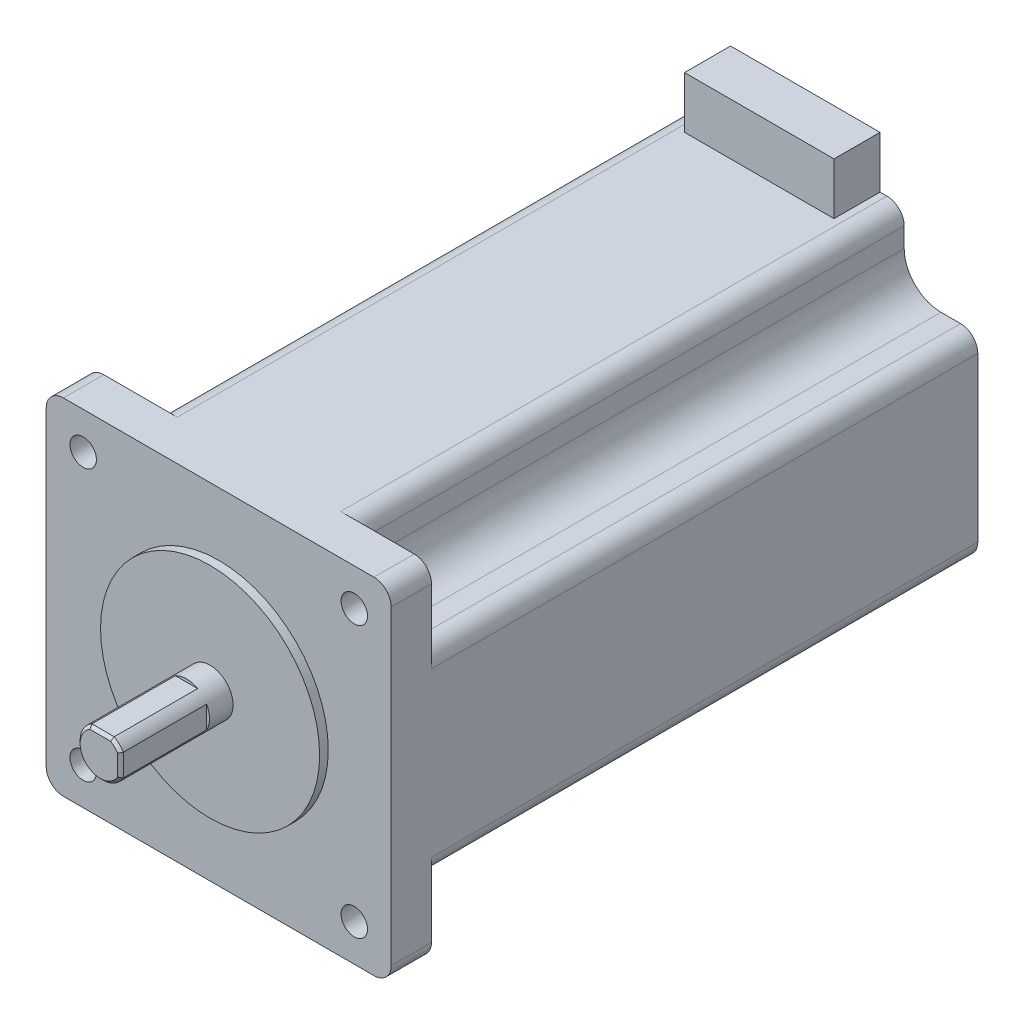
ISO-10303-21;
HEADER;
FILE_DESCRIPTION(('STEP AP214'),'2;1');
FILE_NAME('part.step','',(''),(''),'','','');
FILE_SCHEMA(('AUTOMOTIVE_DESIGN { 1 0 10303 214 1 1 1 1 }'));
ENDSEC;
DATA;
#1=APPLICATION_CONTEXT('core data for automotive mechanical design processes');
#2=APPLICATION_PROTOCOL_DEFINITION('international standard','automotive_design',2000,#1);
#3=PRODUCT_CONTEXT('',#1,'mechanical');
#4=PRODUCT('Part','Part','',(#3));
#5=PRODUCT_RELATED_PRODUCT_CATEGORY('part','',(#4));
#6=PRODUCT_DEFINITION_FORMATION('','',#4);
#7=PRODUCT_DEFINITION_CONTEXT('part definition',#1,'design');
#8=PRODUCT_DEFINITION('design','',#6,#7);
#9=PRODUCT_DEFINITION_SHAPE('','',#8);
#10=(LENGTH_UNIT() NAMED_UNIT(*) SI_UNIT(.MILLI.,.METRE.));
#11=(NAMED_UNIT(*) PLANE_ANGLE_UNIT() SI_UNIT($,.RADIAN.));
#12=(NAMED_UNIT(*) SI_UNIT($,.STERADIAN.) SOLID_ANGLE_UNIT());
#13=UNCERTAINTY_MEASURE_WITH_UNIT(LENGTH_MEASURE(1.E-05),#10,'distance_accuracy_value','');
#14=(GEOMETRIC_REPRESENTATION_CONTEXT(3) GLOBAL_UNCERTAINTY_ASSIGNED_CONTEXT((#13)) GLOBAL_UNIT_ASSIGNED_CONTEXT((#10,
#11,#12)) REPRESENTATION_CONTEXT('',''));
#15=CARTESIAN_POINT('',(0.,0.,0.));
#16=DIRECTION('',(0.,0.,1.));
#17=DIRECTION('',(1.,0.,0.));
#18=AXIS2_PLACEMENT_3D('',#15,#16,#17);
#19=CARTESIAN_POINT('',(13.,39.,-95.5));
#20=DIRECTION('',(1.,0.,0.));
#21=DIRECTION('',(0.,0.,-1.));
#22=AXIS2_PLACEMENT_3D('',#19,#20,#21);
#23=PLANE('',#22);
#24=DIRECTION('',(0.,-1.,0.));
#25=VECTOR('',#24,1.);
#26=CARTESIAN_POINT('',(13.,39.,-103.5));
#27=LINE('',#26,#25);
#28=CARTESIAN_POINT('',(13.,39.,-103.5));
#29=VERTEX_POINT('',#28);
#30=CARTESIAN_POINT('',(13.,30.,-103.5));
#31=VERTEX_POINT('',#30);
#32=EDGE_CURVE('E106',#29,#31,#27,.T.);
#33=ORIENTED_EDGE('',*,*,#32,.F.);
#34=DIRECTION('',(0.,0.,-1.));
#35=VECTOR('',#34,1.);
#36=CARTESIAN_POINT('',(13.,39.,-95.5));
#37=LINE('',#36,#35);
#38=CARTESIAN_POINT('',(13.,39.,-95.5));
#39=VERTEX_POINT('',#38);
#40=EDGE_CURVE('E55',#39,#29,#37,.T.);
#41=ORIENTED_EDGE('',*,*,#40,.F.);
#42=DIRECTION('',(0.,-1.,0.));
#43=VECTOR('',#42,1.);
#44=CARTESIAN_POINT('',(13.,39.,-95.5));
#45=LINE('',#44,#43);
#46=CARTESIAN_POINT('',(13.,30.,-95.5));
#47=VERTEX_POINT('',#46);
#48=EDGE_CURVE('E102',#39,#47,#45,.T.);
#49=ORIENTED_EDGE('',*,*,#48,.T.);
#50=DIRECTION('',(0.,0.,-1.));
#51=VECTOR('',#50,1.);
#52=CARTESIAN_POINT('',(13.,30.,-95.5));
#53=LINE('',#52,#51);
#54=EDGE_CURVE('E12',#47,#31,#53,.T.);
#55=ORIENTED_EDGE('',*,*,#54,.T.);
#56=EDGE_LOOP('',(#33,#41,#49,#55));
#57=FACE_BOUND('',#56,.T.);
#58=ADVANCED_FACE('F45',(#57),#23,.T.);
#59=CARTESIAN_POINT('',(-13.,39.,-95.5));
#60=DIRECTION('',(0.,1.,0.));
#61=DIRECTION('',(0.,0.,1.));
#62=AXIS2_PLACEMENT_3D('',#59,#60,#61);
#63=PLANE('',#62);
#64=DIRECTION('',(1.,0.,0.));
#65=VECTOR('',#64,1.);
#66=CARTESIAN_POINT('',(-13.,39.,-103.5));
#67=LINE('',#66,#65);
#68=CARTESIAN_POINT('',(-13.,39.,-103.5));
#69=VERTEX_POINT('',#68);
#70=EDGE_CURVE('E92',#69,#29,#67,.T.);
#71=ORIENTED_EDGE('',*,*,#70,.F.);
#72=DIRECTION('',(0.,0.,-1.));
#73=VECTOR('',#72,1.);
#74=CARTESIAN_POINT('',(-13.,39.,-95.5));
#75=LINE('',#74,#73);
#76=CARTESIAN_POINT('',(-13.,39.,-95.5));
#77=VERTEX_POINT('',#76);
#78=EDGE_CURVE('E87',#77,#69,#75,.T.);
#79=ORIENTED_EDGE('',*,*,#78,.F.);
#80=DIRECTION('',(1.,0.,0.));
#81=VECTOR('',#80,1.);
#82=CARTESIAN_POINT('',(-13.,39.,-95.5));
#83=LINE('',#82,#81);
#84=EDGE_CURVE('E90',#77,#39,#83,.T.);
#85=ORIENTED_EDGE('',*,*,#84,.T.);
#86=ORIENTED_EDGE('',*,*,#40,.T.);
#87=EDGE_LOOP('',(#71,#79,#85,#86));
#88=FACE_BOUND('',#87,.T.);
#89=ADVANCED_FACE('F89',(#88),#63,.T.);
#90=CARTESIAN_POINT('',(-13.,30.,-95.5));
#91=DIRECTION('',(-1.,0.,0.));
#92=DIRECTION('',(0.,0.,1.));
#93=AXIS2_PLACEMENT_3D('',#90,#91,#92);
#94=PLANE('',#93);
#95=DIRECTION('',(0.,1.,0.));
#96=VECTOR('',#95,1.);
#97=CARTESIAN_POINT('',(-13.,30.,-103.5));
#98=LINE('',#97,#96);
#99=CARTESIAN_POINT('',(-13.,30.,-103.5));
#100=VERTEX_POINT('',#99);
#101=EDGE_CURVE('E111',#100,#69,#98,.T.);
#102=ORIENTED_EDGE('',*,*,#101,.F.);
#103=DIRECTION('',(0.,0.,-1.));
#104=VECTOR('',#103,1.);
#105=CARTESIAN_POINT('',(-13.,30.,-95.5));
#106=LINE('',#105,#104);
#107=CARTESIAN_POINT('',(-13.,30.,-95.5));
#108=VERTEX_POINT('',#107);
#109=EDGE_CURVE('E49',#108,#100,#106,.T.);
#110=ORIENTED_EDGE('',*,*,#109,.F.);
#111=DIRECTION('',(0.,1.,0.));
#112=VECTOR('',#111,1.);
#113=CARTESIAN_POINT('',(-13.,30.,-95.5));
#114=LINE('',#113,#112);
#115=EDGE_CURVE('E100',#108,#77,#114,.T.);
#116=ORIENTED_EDGE('',*,*,#115,.T.);
#117=ORIENTED_EDGE('',*,*,#78,.T.);
#118=EDGE_LOOP('',(#102,#110,#116,#117));
#119=FACE_BOUND('',#118,.T.);
#120=ADVANCED_FACE('F104',(#119),#94,.T.);
#121=CARTESIAN_POINT('',(0.,30.,-95.5));
#122=DIRECTION('',(0.,-1.,0.));
#123=DIRECTION('',(1.,0.,0.));
#124=AXIS2_PLACEMENT_3D('',#121,#122,#123);
#125=PLANE('',#124);
#126=DIRECTION('',(-1.,0.,0.));
#127=VECTOR('',#126,1.);
#128=CARTESIAN_POINT('',(0.,30.,-103.5));
#129=LINE('',#128,#127);
#130=EDGE_CURVE('E82',#31,#100,#129,.T.);
#131=ORIENTED_EDGE('',*,*,#130,.F.);
#132=ORIENTED_EDGE('',*,*,#54,.F.);
#133=DIRECTION('',(-1.,0.,0.));
#134=VECTOR('',#133,1.);
#135=CARTESIAN_POINT('',(13.,30.,-95.5));
#136=LINE('',#135,#134);
#137=EDGE_CURVE('E84',#47,#108,#136,.T.);
#138=ORIENTED_EDGE('',*,*,#137,.T.);
#139=ORIENTED_EDGE('',*,*,#109,.T.);
#140=EDGE_LOOP('',(#131,#132,#138,#139));
#141=FACE_BOUND('',#140,.T.);
#142=ADVANCED_FACE('F47',(#141),#125,.T.);
#143=CARTESIAN_POINT('',(0.,0.,-95.5));
#144=DIRECTION('',(0.,0.,-1.));
#145=DIRECTION('',(-1.,0.,0.));
#146=AXIS2_PLACEMENT_3D('',#143,#144,#145);
#147=PLANE('',#146);
#148=ORIENTED_EDGE('',*,*,#137,.F.);
#149=ORIENTED_EDGE('',*,*,#48,.F.);
#150=ORIENTED_EDGE('',*,*,#84,.F.);
#151=ORIENTED_EDGE('',*,*,#115,.F.);
#152=EDGE_LOOP('',(#148,#149,#150,#151));
#153=FACE_BOUND('',#152,.T.);
#154=ADVANCED_FACE('F99',(#153),#147,.F.);
#155=CARTESIAN_POINT('',(0.,0.,-103.5));
#156=DIRECTION('',(0.,0.,-1.));
#157=DIRECTION('',(-1.,0.,0.));
#158=AXIS2_PLACEMENT_3D('',#155,#156,#157);
#159=PLANE('',#158);
#160=ORIENTED_EDGE('',*,*,#32,.T.);
#161=ORIENTED_EDGE('',*,*,#130,.T.);
#162=ORIENTED_EDGE('',*,*,#101,.T.);
#163=ORIENTED_EDGE('',*,*,#70,.T.);
#164=EDGE_LOOP('',(#160,#161,#162,#163));
#165=FACE_BOUND('',#164,.T.);
#166=ADVANCED_FACE('F118',(#165),#159,.T.);
#167=CLOSED_SHELL('',(#58,#89,#120,#142,#154,#166));
#168=MANIFOLD_SOLID_BREP('B2',#167);
#169=CARTESIAN_POINT('',(27.,-27.,-103.5));
#170=DIRECTION('',(0.,0.,1.));
#171=DIRECTION('',(1.,0.,0.));
#172=AXIS2_PLACEMENT_3D('',#169,#170,#171);
#173=CYLINDRICAL_SURFACE('',#172,3.);
#174=CARTESIAN_POINT('',(27.,-27.,-8.49999999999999));
#175=DIRECTION('',(0.,0.,-1.));
#176=DIRECTION('',(-1.,0.,0.));
#177=AXIS2_PLACEMENT_3D('',#174,#175,#176);
#178=CIRCLE('',#177,3.);
#179=CARTESIAN_POINT('',(30.,-27.,-8.49999999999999));
#180=VERTEX_POINT('',#179);
#181=CARTESIAN_POINT('',(27.,-30.,-8.49999999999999));
#182=VERTEX_POINT('',#181);
#183=EDGE_CURVE('E470',#180,#182,#178,.T.);
#184=ORIENTED_EDGE('',*,*,#183,.F.);
#185=DIRECTION('',(0.,0.,1.));
#186=VECTOR('',#185,1.);
#187=CARTESIAN_POINT('',(30.,-27.,-103.5));
#188=LINE('',#187,#186);
#189=CARTESIAN_POINT('',(30.,-27.,-1.5));
#190=VERTEX_POINT('',#189);
#191=EDGE_CURVE('E645',#180,#190,#188,.T.);
#192=ORIENTED_EDGE('',*,*,#191,.T.);
#193=CARTESIAN_POINT('',(27.,-27.,-1.5));
#194=DIRECTION('',(0.,0.,-1.));
#195=DIRECTION('',(1.,0.,0.));
#196=AXIS2_PLACEMENT_3D('',#193,#194,#195);
#197=CIRCLE('',#196,3.);
#198=CARTESIAN_POINT('',(27.,-30.,-1.5));
#199=VERTEX_POINT('',#198);
#200=EDGE_CURVE('E635',#190,#199,#197,.T.);
#201=ORIENTED_EDGE('',*,*,#200,.T.);
#202=DIRECTION('',(0.,0.,1.));
#203=VECTOR('',#202,1.);
#204=CARTESIAN_POINT('',(27.,-30.,-103.5));
#205=LINE('',#204,#203);
#206=EDGE_CURVE('E681',#182,#199,#205,.T.);
#207=ORIENTED_EDGE('',*,*,#206,.F.);
#208=EDGE_LOOP('',(#184,#192,#201,#207));
#209=FACE_BOUND('',#208,.T.);
#210=ADVANCED_FACE('F172',(#209),#173,.T.);
#211=CARTESIAN_POINT('',(23.57,-23.57,-103.5));
#212=DIRECTION('',(0.,0.,1.));
#213=DIRECTION('',(1.,0.,0.));
#214=AXIS2_PLACEMENT_3D('',#211,#212,#213);
#215=CYLINDRICAL_SURFACE('',#214,2.3);
#216=CARTESIAN_POINT('',(23.57,-23.57,-1.5));
#217=DIRECTION('',(0.,0.,-1.));
#218=DIRECTION('',(-1.,0.,0.));
#219=AXIS2_PLACEMENT_3D('',#216,#217,#218);
#220=CIRCLE('',#219,2.3);
#221=CARTESIAN_POINT('',(21.27,-23.57,-1.5));
#222=VERTEX_POINT('',#221);
#223=EDGE_CURVE('E626',#222,#222,#220,.T.);
#224=ORIENTED_EDGE('',*,*,#223,.F.);
#225=EDGE_LOOP('',(#224));
#226=FACE_BOUND('',#225,.T.);
#227=CARTESIAN_POINT('',(23.57,-23.57,-8.49999999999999));
#228=DIRECTION('',(0.,0.,-1.));
#229=DIRECTION('',(-1.,0.,0.));
#230=AXIS2_PLACEMENT_3D('',#227,#228,#229);
#231=CIRCLE('',#230,2.3);
#232=CARTESIAN_POINT('',(21.27,-23.57,-8.49999999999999));
#233=VERTEX_POINT('',#232);
#234=EDGE_CURVE('E177',#233,#233,#231,.T.);
#235=ORIENTED_EDGE('',*,*,#234,.T.);
#236=EDGE_LOOP('',(#235));
#237=FACE_BOUND('',#236,.T.);
#238=ADVANCED_FACE('F894',(#226,#237),#215,.F.);
#239=CARTESIAN_POINT('',(-27.,-27.,-103.5));
#240=DIRECTION('',(0.,0.,1.));
#241=DIRECTION('',(1.,0.,0.));
#242=AXIS2_PLACEMENT_3D('',#239,#240,#241);
#243=CYLINDRICAL_SURFACE('',#242,3.);
#244=CARTESIAN_POINT('',(-27.,-27.,-8.49999999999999));
#245=DIRECTION('',(0.,0.,-1.));
#246=DIRECTION('',(-1.,0.,0.));
#247=AXIS2_PLACEMENT_3D('',#244,#245,#246);
#248=CIRCLE('',#247,3.);
#249=CARTESIAN_POINT('',(-27.,-30.,-8.49999999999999));
#250=VERTEX_POINT('',#249);
#251=CARTESIAN_POINT('',(-30.,-27.,-8.49999999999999));
#252=VERTEX_POINT('',#251);
#253=EDGE_CURVE('E198',#250,#252,#248,.T.);
#254=ORIENTED_EDGE('',*,*,#253,.F.);
#255=DIRECTION('',(0.,0.,1.));
#256=VECTOR('',#255,1.);
#257=CARTESIAN_POINT('',(-27.,-30.,-103.5));
#258=LINE('',#257,#256);
#259=CARTESIAN_POINT('',(-27.,-30.,-1.5));
#260=VERTEX_POINT('',#259);
#261=EDGE_CURVE('E679',#250,#260,#258,.T.);
#262=ORIENTED_EDGE('',*,*,#261,.T.);
#263=CARTESIAN_POINT('',(-27.,-27.,-1.5));
#264=DIRECTION('',(0.,0.,-1.));
#265=DIRECTION('',(1.,0.,0.));
#266=AXIS2_PLACEMENT_3D('',#263,#264,#265);
#267=CIRCLE('',#266,3.);
#268=CARTESIAN_POINT('',(-30.,-27.,-1.5));
#269=VERTEX_POINT('',#268);
#270=EDGE_CURVE('E651',#260,#269,#267,.T.);
#271=ORIENTED_EDGE('',*,*,#270,.T.);
#272=DIRECTION('',(0.,0.,1.));
#273=VECTOR('',#272,1.);
#274=CARTESIAN_POINT('',(-30.,-27.,-103.5));
#275=LINE('',#274,#273);
#276=EDGE_CURVE('E677',#252,#269,#275,.T.);
#277=ORIENTED_EDGE('',*,*,#276,.F.);
#278=EDGE_LOOP('',(#254,#262,#271,#277));
#279=FACE_BOUND('',#278,.T.);
#280=ADVANCED_FACE('F785',(#279),#243,.T.);
#281=CARTESIAN_POINT('',(-23.57,-23.57,-103.5));
#282=DIRECTION('',(0.,0.,1.));
#283=DIRECTION('',(1.,0.,0.));
#284=AXIS2_PLACEMENT_3D('',#281,#282,#283);
#285=CYLINDRICAL_SURFACE('',#284,2.3);
#286=CARTESIAN_POINT('',(-23.57,-23.57,-1.5));
#287=DIRECTION('',(0.,0.,-1.));
#288=DIRECTION('',(-1.,0.,0.));
#289=AXIS2_PLACEMENT_3D('',#286,#287,#288);
#290=CIRCLE('',#289,2.3);
#291=CARTESIAN_POINT('',(-25.87,-23.57,-1.5));
#292=VERTEX_POINT('',#291);
#293=EDGE_CURVE('E629',#292,#292,#290,.T.);
#294=ORIENTED_EDGE('',*,*,#293,.F.);
#295=EDGE_LOOP('',(#294));
#296=FACE_BOUND('',#295,.T.);
#297=CARTESIAN_POINT('',(-23.57,-23.57,-8.49999999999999));
#298=DIRECTION('',(0.,0.,-1.));
#299=DIRECTION('',(-1.,0.,0.));
#300=AXIS2_PLACEMENT_3D('',#297,#298,#299);
#301=CIRCLE('',#300,2.3);
#302=CARTESIAN_POINT('',(-25.87,-23.57,-8.49999999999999));
#303=VERTEX_POINT('',#302);
#304=EDGE_CURVE('E507',#303,#303,#301,.T.);
#305=ORIENTED_EDGE('',*,*,#304,.T.);
#306=EDGE_LOOP('',(#305));
#307=FACE_BOUND('',#306,.T.);
#308=ADVANCED_FACE('F772',(#296,#307),#285,.F.);
#309=CARTESIAN_POINT('',(27.,27.,-103.5));
#310=DIRECTION('',(0.,0.,1.));
#311=DIRECTION('',(1.,0.,0.));
#312=AXIS2_PLACEMENT_3D('',#309,#310,#311);
#313=CYLINDRICAL_SURFACE('',#312,3.);
#314=CARTESIAN_POINT('',(27.,27.,-8.49999999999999));
#315=DIRECTION('',(0.,0.,-1.));
#316=DIRECTION('',(-1.,0.,0.));
#317=AXIS2_PLACEMENT_3D('',#314,#315,#316);
#318=CIRCLE('',#317,3.);
#319=CARTESIAN_POINT('',(27.,30.,-8.49999999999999));
#320=VERTEX_POINT('',#319);
#321=CARTESIAN_POINT('',(30.,27.,-8.49999999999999));
#322=VERTEX_POINT('',#321);
#323=EDGE_CURVE('E569',#320,#322,#318,.T.);
#324=ORIENTED_EDGE('',*,*,#323,.F.);
#325=DIRECTION('',(0.,0.,1.));
#326=VECTOR('',#325,1.);
#327=CARTESIAN_POINT('',(27.,30.,-103.5));
#328=LINE('',#327,#326);
#329=CARTESIAN_POINT('',(27.,30.,-1.5));
#330=VERTEX_POINT('',#329);
#331=EDGE_CURVE('E671',#320,#330,#328,.T.);
#332=ORIENTED_EDGE('',*,*,#331,.T.);
#333=CARTESIAN_POINT('',(27.,27.,-1.5));
#334=DIRECTION('',(0.,0.,-1.));
#335=DIRECTION('',(1.,0.,0.));
#336=AXIS2_PLACEMENT_3D('',#333,#334,#335);
#337=CIRCLE('',#336,3.);
#338=CARTESIAN_POINT('',(30.,27.,-1.5));
#339=VERTEX_POINT('',#338);
#340=EDGE_CURVE('E663',#330,#339,#337,.T.);
#341=ORIENTED_EDGE('',*,*,#340,.T.);
#342=DIRECTION('',(0.,0.,1.));
#343=VECTOR('',#342,1.);
#344=CARTESIAN_POINT('',(30.,27.,-103.5));
#345=LINE('',#344,#343);
#346=EDGE_CURVE('E669',#322,#339,#345,.T.);
#347=ORIENTED_EDGE('',*,*,#346,.F.);
#348=EDGE_LOOP('',(#324,#332,#341,#347));
#349=FACE_BOUND('',#348,.T.);
#350=ADVANCED_FACE('F848',(#349),#313,.T.);
#351=CARTESIAN_POINT('',(23.57,23.57,-103.5));
#352=DIRECTION('',(0.,0.,1.));
#353=DIRECTION('',(1.,0.,0.));
#354=AXIS2_PLACEMENT_3D('',#351,#352,#353);
#355=CYLINDRICAL_SURFACE('',#354,2.3);
#356=CARTESIAN_POINT('',(23.57,23.57,-1.5));
#357=DIRECTION('',(0.,0.,-1.));
#358=DIRECTION('',(-1.,0.,0.));
#359=AXIS2_PLACEMENT_3D('',#356,#357,#358);
#360=CIRCLE('',#359,2.3);
#361=CARTESIAN_POINT('',(21.27,23.57,-1.5));
#362=VERTEX_POINT('',#361);
#363=EDGE_CURVE('E623',#362,#362,#360,.T.);
#364=ORIENTED_EDGE('',*,*,#363,.F.);
#365=EDGE_LOOP('',(#364));
#366=FACE_BOUND('',#365,.T.);
#367=CARTESIAN_POINT('',(23.57,23.57,-8.49999999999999));
#368=DIRECTION('',(0.,0.,-1.));
#369=DIRECTION('',(-1.,0.,0.));
#370=AXIS2_PLACEMENT_3D('',#367,#368,#369);
#371=CIRCLE('',#370,2.3);
#372=CARTESIAN_POINT('',(21.27,23.57,-8.49999999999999));
#373=VERTEX_POINT('',#372);
#374=EDGE_CURVE('E556',#373,#373,#371,.T.);
#375=ORIENTED_EDGE('',*,*,#374,.T.);
#376=EDGE_LOOP('',(#375));
#377=FACE_BOUND('',#376,.T.);
#378=ADVANCED_FACE('F977',(#366,#377),#355,.F.);
#379=CARTESIAN_POINT('',(-27.,27.,-103.5));
#380=DIRECTION('',(0.,0.,1.));
#381=DIRECTION('',(1.,0.,0.));
#382=AXIS2_PLACEMENT_3D('',#379,#380,#381);
#383=CYLINDRICAL_SURFACE('',#382,3.);
#384=CARTESIAN_POINT('',(-27.,27.,-8.49999999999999));
#385=DIRECTION('',(0.,0.,-1.));
#386=DIRECTION('',(-1.,0.,0.));
#387=AXIS2_PLACEMENT_3D('',#384,#385,#386);
#388=CIRCLE('',#387,3.);
#389=CARTESIAN_POINT('',(-30.,27.,-8.49999999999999));
#390=VERTEX_POINT('',#389);
#391=CARTESIAN_POINT('',(-27.,30.,-8.49999999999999));
#392=VERTEX_POINT('',#391);
#393=EDGE_CURVE('E619',#390,#392,#388,.T.);
#394=ORIENTED_EDGE('',*,*,#393,.F.);
#395=DIRECTION('',(0.,0.,1.));
#396=VECTOR('',#395,1.);
#397=CARTESIAN_POINT('',(-30.,27.,-103.5));
#398=LINE('',#397,#396);
#399=CARTESIAN_POINT('',(-30.,27.,-1.5));
#400=VERTEX_POINT('',#399);
#401=EDGE_CURVE('E675',#390,#400,#398,.T.);
#402=ORIENTED_EDGE('',*,*,#401,.T.);
#403=CARTESIAN_POINT('',(-27.,27.,-1.5));
#404=DIRECTION('',(0.,0.,-1.));
#405=DIRECTION('',(1.,0.,0.));
#406=AXIS2_PLACEMENT_3D('',#403,#404,#405);
#407=CIRCLE('',#406,3.);
#408=CARTESIAN_POINT('',(-27.,30.,-1.5));
#409=VERTEX_POINT('',#408);
#410=EDGE_CURVE('E657',#400,#409,#407,.T.);
#411=ORIENTED_EDGE('',*,*,#410,.T.);
#412=DIRECTION('',(0.,0.,1.));
#413=VECTOR('',#412,1.);
#414=CARTESIAN_POINT('',(-27.,30.,-103.5));
#415=LINE('',#414,#413);
#416=EDGE_CURVE('E673',#392,#409,#415,.T.);
#417=ORIENTED_EDGE('',*,*,#416,.F.);
#418=EDGE_LOOP('',(#394,#402,#411,#417));
#419=FACE_BOUND('',#418,.T.);
#420=ADVANCED_FACE('F857',(#419),#383,.T.);
#421=CARTESIAN_POINT('',(-23.57,23.57,-103.5));
#422=DIRECTION('',(0.,0.,1.));
#423=DIRECTION('',(1.,0.,0.));
#424=AXIS2_PLACEMENT_3D('',#421,#422,#423);
#425=CYLINDRICAL_SURFACE('',#424,2.3);
#426=CARTESIAN_POINT('',(-23.57,23.57,-1.5));
#427=DIRECTION('',(0.,0.,-1.));
#428=DIRECTION('',(-1.,0.,0.));
#429=AXIS2_PLACEMENT_3D('',#426,#427,#428);
#430=CIRCLE('',#429,2.3);
#431=CARTESIAN_POINT('',(-25.87,23.57,-1.5));
#432=VERTEX_POINT('',#431);
#433=EDGE_CURVE('E632',#432,#432,#430,.T.);
#434=ORIENTED_EDGE('',*,*,#433,.F.);
#435=EDGE_LOOP('',(#434));
#436=FACE_BOUND('',#435,.T.);
#437=CARTESIAN_POINT('',(-23.57,23.57,-8.49999999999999));
#438=DIRECTION('',(0.,0.,-1.));
#439=DIRECTION('',(-1.,0.,0.));
#440=AXIS2_PLACEMENT_3D('',#437,#438,#439);
#441=CIRCLE('',#440,2.3);
#442=CARTESIAN_POINT('',(-25.87,23.57,-8.49999999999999));
#443=VERTEX_POINT('',#442);
#444=EDGE_CURVE('E606',#443,#443,#441,.T.);
#445=ORIENTED_EDGE('',*,*,#444,.T.);
#446=EDGE_LOOP('',(#445));
#447=FACE_BOUND('',#446,.T.);
#448=ADVANCED_FACE('F931',(#436,#447),#425,.F.);
#449=CARTESIAN_POINT('',(0.,0.,0.));
#450=DIRECTION('',(0.,0.,1.));
#451=DIRECTION('',(1.,0.,0.));
#452=AXIS2_PLACEMENT_3D('',#449,#450,#451);
#453=PLANE('',#452);
#454=CARTESIAN_POINT('',(0.,0.,0.));
#455=DIRECTION('',(0.,0.,1.));
#456=DIRECTION('',(1.,0.,0.));
#457=AXIS2_PLACEMENT_3D('',#454,#455,#456);
#458=CIRCLE('',#457,19.05);
#459=CARTESIAN_POINT('',(19.05,0.,0.));
#460=VERTEX_POINT('',#459);
#461=EDGE_CURVE('E707',#460,#460,#458,.T.);
#462=ORIENTED_EDGE('',*,*,#461,.T.);
#463=EDGE_LOOP('',(#462));
#464=FACE_BOUND('',#463,.T.);
#465=CARTESIAN_POINT('',(0.,0.,0.));
#466=DIRECTION('',(0.,0.,1.));
#467=DIRECTION('',(1.,0.,0.));
#468=AXIS2_PLACEMENT_3D('',#465,#466,#467);
#469=CIRCLE('',#468,4.);
#470=CARTESIAN_POINT('',(4.,0.,0.));
#471=VERTEX_POINT('',#470);
#472=EDGE_CURVE('E704',#471,#471,#469,.T.);
#473=ORIENTED_EDGE('',*,*,#472,.F.);
#474=EDGE_LOOP('',(#473));
#475=FACE_BOUND('',#474,.T.);
#476=ADVANCED_FACE('F929',(#464,#475),#453,.T.);
#477=CARTESIAN_POINT('',(0.,0.,-1.5));
#478=DIRECTION('',(0.,0.,1.));
#479=DIRECTION('',(1.,0.,0.));
#480=AXIS2_PLACEMENT_3D('',#477,#478,#479);
#481=CYLINDRICAL_SURFACE('',#480,19.05);
#482=CARTESIAN_POINT('',(0.,0.,-1.5));
#483=DIRECTION('',(0.,0.,1.));
#484=DIRECTION('',(1.,0.,0.));
#485=AXIS2_PLACEMENT_3D('',#482,#483,#484);
#486=CIRCLE('',#485,19.05);
#487=CARTESIAN_POINT('',(19.05,0.,-1.5));
#488=VERTEX_POINT('',#487);
#489=EDGE_CURVE('E683',#488,#488,#486,.F.);
#490=ORIENTED_EDGE('',*,*,#489,.F.);
#491=EDGE_LOOP('',(#490));
#492=FACE_BOUND('',#491,.T.);
#493=ORIENTED_EDGE('',*,*,#461,.F.);
#494=EDGE_LOOP('',(#493));
#495=FACE_BOUND('',#494,.T.);
#496=ADVANCED_FACE('F927',(#492,#495),#481,.T.);
#497=CARTESIAN_POINT('',(0.,0.,19.1));
#498=DIRECTION('',(0.,0.,-1.));
#499=DIRECTION('',(-1.,0.,0.));
#500=AXIS2_PLACEMENT_3D('',#497,#498,#499);
#501=CYLINDRICAL_SURFACE('',#500,4.);
#502=DIRECTION('',(0.,0.,-1.));
#503=VECTOR('',#502,1.);
#504=CARTESIAN_POINT('',(1.93649167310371,3.5,19.1));
#505=LINE('',#504,#503);
#506=CARTESIAN_POINT('',(1.93649167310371,3.5,4.1));
#507=VERTEX_POINT('',#506);
#508=CARTESIAN_POINT('',(1.93649167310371,3.5,18.6));
#509=VERTEX_POINT('',#508);
#510=EDGE_CURVE('E699',#507,#509,#505,.F.);
#511=ORIENTED_EDGE('',*,*,#510,.T.);
#512=CARTESIAN_POINT('',(0.,0.,18.6));
#513=DIRECTION('',(0.,0.,1.));
#514=DIRECTION('',(1.,0.,0.));
#515=AXIS2_PLACEMENT_3D('',#512,#513,#514);
#516=CIRCLE('',#515,4.);
#517=CARTESIAN_POINT('',(3.5,1.93649167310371,18.6));
#518=VERTEX_POINT('',#517);
#519=EDGE_CURVE('E182',#509,#518,#516,.F.);
#520=ORIENTED_EDGE('',*,*,#519,.T.);
#521=DIRECTION('',(0.,0.,-1.));
#522=VECTOR('',#521,1.);
#523=CARTESIAN_POINT('',(3.5,1.93649167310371,19.1));
#524=LINE('',#523,#522);
#525=CARTESIAN_POINT('',(3.5,1.93649167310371,4.1));
#526=VERTEX_POINT('',#525);
#527=EDGE_CURVE('E694',#518,#526,#524,.T.);
#528=ORIENTED_EDGE('',*,*,#527,.T.);
#529=CARTESIAN_POINT('',(0.,0.,4.1));
#530=DIRECTION('',(0.,0.,1.));
#531=DIRECTION('',(1.,0.,0.));
#532=AXIS2_PLACEMENT_3D('',#529,#530,#531);
#533=CIRCLE('',#532,4.);
#534=CARTESIAN_POINT('',(3.5,-1.93649167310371,4.1));
#535=VERTEX_POINT('',#534);
#536=EDGE_CURVE('E713',#535,#526,#533,.T.);
#537=ORIENTED_EDGE('',*,*,#536,.F.);
#538=DIRECTION('',(0.,0.,-1.));
#539=VECTOR('',#538,1.);
#540=CARTESIAN_POINT('',(3.5,-1.93649167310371,19.1));
#541=LINE('',#540,#539);
#542=CARTESIAN_POINT('',(3.5,-1.93649167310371,18.6));
#543=VERTEX_POINT('',#542);
#544=EDGE_CURVE('E690',#535,#543,#541,.F.);
#545=ORIENTED_EDGE('',*,*,#544,.T.);
#546=CARTESIAN_POINT('',(0.,0.,18.6));
#547=DIRECTION('',(0.,0.,1.));
#548=DIRECTION('',(1.,0.,0.));
#549=AXIS2_PLACEMENT_3D('',#546,#547,#548);
#550=CIRCLE('',#549,4.);
#551=CARTESIAN_POINT('',(-1.93649167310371,3.5,18.6));
#552=VERTEX_POINT('',#551);
#553=EDGE_CURVE('E728',#543,#552,#550,.F.);
#554=ORIENTED_EDGE('',*,*,#553,.T.);
#555=DIRECTION('',(0.,0.,-1.));
#556=VECTOR('',#555,1.);
#557=CARTESIAN_POINT('',(-1.93649167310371,3.5,19.1));
#558=LINE('',#557,#556);
#559=CARTESIAN_POINT('',(-1.93649167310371,3.5,4.1));
#560=VERTEX_POINT('',#559);
#561=EDGE_CURVE('E702',#552,#560,#558,.T.);
#562=ORIENTED_EDGE('',*,*,#561,.T.);
#563=CARTESIAN_POINT('',(0.,0.,4.1));
#564=DIRECTION('',(0.,0.,1.));
#565=DIRECTION('',(1.,0.,0.));
#566=AXIS2_PLACEMENT_3D('',#563,#564,#565);
#567=CIRCLE('',#566,4.);
#568=EDGE_CURVE('E710',#507,#560,#567,.T.);
#569=ORIENTED_EDGE('',*,*,#568,.F.);
#570=EDGE_LOOP('',(#511,#520,#528,#537,#545,#554,#562,#569));
#571=FACE_BOUND('',#570,.T.);
#572=ORIENTED_EDGE('',*,*,#472,.T.);
#573=EDGE_LOOP('',(#572));
#574=FACE_BOUND('',#573,.T.);
#575=ADVANCED_FACE('F923',(#571,#574),#501,.T.);
#576=CARTESIAN_POINT('',(0.,0.,19.1));
#577=DIRECTION('',(0.,0.,1.));
#578=DIRECTION('',(1.,0.,0.));
#579=AXIS2_PLACEMENT_3D('',#576,#577,#578);
#580=PLANE('',#579);
#581=CARTESIAN_POINT('',(0.,0.,19.1));
#582=DIRECTION('',(0.,0.,1.));
#583=DIRECTION('',(1.,0.,0.));
#584=AXIS2_PLACEMENT_3D('',#581,#582,#583);
#585=CIRCLE('',#584,3.49999999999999);
#586=CARTESIAN_POINT('',(2.99999999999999,1.8027756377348,19.1));
#587=VERTEX_POINT('',#586);
#588=CARTESIAN_POINT('',(1.8027756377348,2.99999999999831,19.1));
#589=VERTEX_POINT('',#588);
#590=EDGE_CURVE('E723',#587,#589,#585,.T.);
#591=ORIENTED_EDGE('',*,*,#590,.T.);
#592=DIRECTION('',(-1.,0.,0.));
#593=VECTOR('',#592,1.);
#594=CARTESIAN_POINT('',(-1.93649167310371,2.99999999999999,19.1));
#595=LINE('',#594,#593);
#596=CARTESIAN_POINT('',(-1.8027756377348,2.99999999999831,19.1));
#597=VERTEX_POINT('',#596);
#598=EDGE_CURVE('E725',#589,#597,#595,.T.);
#599=ORIENTED_EDGE('',*,*,#598,.T.);
#600=CARTESIAN_POINT('',(0.,0.,19.1));
#601=DIRECTION('',(0.,0.,1.));
#602=DIRECTION('',(1.,0.,0.));
#603=AXIS2_PLACEMENT_3D('',#600,#601,#602);
#604=CIRCLE('',#603,3.49999999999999);
#605=CARTESIAN_POINT('',(2.99999999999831,-1.8027756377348,19.1));
#606=VERTEX_POINT('',#605);
#607=EDGE_CURVE('E719',#597,#606,#604,.T.);
#608=ORIENTED_EDGE('',*,*,#607,.T.);
#609=DIRECTION('',(0.,1.,0.));
#610=VECTOR('',#609,1.);
#611=CARTESIAN_POINT('',(2.99999999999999,1.93649167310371,19.1));
#612=LINE('',#611,#610);
#613=EDGE_CURVE('E721',#606,#587,#612,.T.);
#614=ORIENTED_EDGE('',*,*,#613,.T.);
#615=EDGE_LOOP('',(#591,#599,#608,#614));
#616=FACE_BOUND('',#615,.T.);
#617=ADVANCED_FACE('F916',(#616),#580,.T.);
#618=CARTESIAN_POINT('',(0.,0.,4.1));
#619=DIRECTION('',(0.,0.,1.));
#620=DIRECTION('',(1.,0.,0.));
#621=AXIS2_PLACEMENT_3D('',#618,#619,#620);
#622=PLANE('',#621);
#623=ORIENTED_EDGE('',*,*,#568,.T.);
#624=DIRECTION('',(1.,0.,0.));
#625=VECTOR('',#624,1.);
#626=CARTESIAN_POINT('',(-4.,3.5,4.1));
#627=LINE('',#626,#625);
#628=EDGE_CURVE('E696',#560,#507,#627,.T.);
#629=ORIENTED_EDGE('',*,*,#628,.T.);
#630=EDGE_LOOP('',(#623,#629));
#631=FACE_BOUND('',#630,.T.);
#632=ADVANCED_FACE('F913',(#631),#622,.T.);
#633=CARTESIAN_POINT('',(0.,3.5,4.1));
#634=DIRECTION('',(0.,-1.,0.));
#635=DIRECTION('',(0.,0.,-1.));
#636=AXIS2_PLACEMENT_3D('',#633,#634,#635);
#637=PLANE('',#636);
#638=ORIENTED_EDGE('',*,*,#561,.F.);
#639=DIRECTION('',(1.,0.,0.));
#640=VECTOR('',#639,1.);
#641=CARTESIAN_POINT('',(1.93649167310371,3.5,18.6));
#642=LINE('',#641,#640);
#643=EDGE_CURVE('E716',#552,#509,#642,.T.);
#644=ORIENTED_EDGE('',*,*,#643,.T.);
#645=ORIENTED_EDGE('',*,*,#510,.F.);
#646=ORIENTED_EDGE('',*,*,#628,.F.);
#647=EDGE_LOOP('',(#638,#644,#645,#646));
#648=FACE_BOUND('',#647,.T.);
#649=ADVANCED_FACE('F908',(#648),#637,.F.);
#650=CARTESIAN_POINT('',(0.,0.,4.1));
#651=DIRECTION('',(0.,0.,1.));
#652=DIRECTION('',(1.,0.,0.));
#653=AXIS2_PLACEMENT_3D('',#650,#651,#652);
#654=PLANE('',#653);
#655=ORIENTED_EDGE('',*,*,#536,.T.);
#656=DIRECTION('',(0.,-1.,0.));
#657=VECTOR('',#656,1.);
#658=CARTESIAN_POINT('',(3.5,3.5,4.1));
#659=LINE('',#658,#657);
#660=EDGE_CURVE('E687',#526,#535,#659,.T.);
#661=ORIENTED_EDGE('',*,*,#660,.T.);
#662=EDGE_LOOP('',(#655,#661));
#663=FACE_BOUND('',#662,.T.);
#664=ADVANCED_FACE('F904',(#663),#654,.T.);
#665=CARTESIAN_POINT('',(3.5,0.,4.1));
#666=DIRECTION('',(-1.,0.,0.));
#667=DIRECTION('',(0.,0.,1.));
#668=AXIS2_PLACEMENT_3D('',#665,#666,#667);
#669=PLANE('',#668);
#670=ORIENTED_EDGE('',*,*,#527,.F.);
#671=DIRECTION('',(0.,-1.,0.));
#672=VECTOR('',#671,1.);
#673=CARTESIAN_POINT('',(3.5,-1.93649167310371,18.6));
#674=LINE('',#673,#672);
#675=EDGE_CURVE('E43',#518,#543,#674,.T.);
#676=ORIENTED_EDGE('',*,*,#675,.T.);
#677=ORIENTED_EDGE('',*,*,#544,.F.);
#678=ORIENTED_EDGE('',*,*,#660,.F.);
#679=EDGE_LOOP('',(#670,#676,#677,#678));
#680=FACE_BOUND('',#679,.T.);
#681=ADVANCED_FACE('F907',(#680),#669,.F.);
#682=CARTESIAN_POINT('',(3.5,0.,18.6));
#683=DIRECTION('',(0.707106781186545,0.,0.70710678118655));
#684=DIRECTION('',(0.,1.,0.));
#685=AXIS2_PLACEMENT_3D('',#682,#683,#684);
#686=PLANE('',#685);
#687=CARTESIAN_POINT('',(3.5,1.93649167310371,18.6));
#688=CARTESIAN_POINT('',(3.41656387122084,1.91497488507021,18.6834361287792));
#689=CARTESIAN_POINT('',(3.33317916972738,1.89307349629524,18.7668208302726));
#690=CARTESIAN_POINT('',(3.16651250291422,1.84850148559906,18.9334874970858));
#691=CARTESIAN_POINT('',(3.08323053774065,1.82583086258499,19.0167694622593));
#692=CARTESIAN_POINT('',(2.99999999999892,1.80277563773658,19.1000000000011));
#693=B_SPLINE_CURVE_WITH_KNOTS('',3,(#687,#688,#689,#690,#691,#692),.UNSPECIFIED.,.F.,.F.,(4,2,
4),(0.,0.3598210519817,0.719642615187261),.UNSPECIFIED.);
#694=EDGE_CURVE('E762',#587,#518,#693,.F.);
#695=ORIENTED_EDGE('',*,*,#694,.F.);
#696=ORIENTED_EDGE('',*,*,#613,.F.);
#697=CARTESIAN_POINT('',(3.5,-1.93649167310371,18.6));
#698=CARTESIAN_POINT('',(3.416563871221,-1.91497488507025,18.683436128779));
#699=CARTESIAN_POINT('',(3.33317916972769,-1.89307349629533,18.7668208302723));
#700=CARTESIAN_POINT('',(3.16651250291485,-1.84850148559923,18.9334874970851));
#701=CARTESIAN_POINT('',(3.08323053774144,-1.8258308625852,19.0167694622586));
#702=CARTESIAN_POINT('',(2.99999999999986,-1.80277563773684,19.1000000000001));
#703=B_SPLINE_CURVE_WITH_KNOTS('',3,(#697,#698,#699,#700,#701,#702),.UNSPECIFIED.,.F.,.F.,(4,2,
4),(0.,0.359821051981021,0.719642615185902),.UNSPECIFIED.);
#704=EDGE_CURVE('E691',#543,#606,#703,.T.);
#705=ORIENTED_EDGE('',*,*,#704,.F.);
#706=ORIENTED_EDGE('',*,*,#675,.F.);
#707=EDGE_LOOP('',(#695,#696,#705,#706));
#708=FACE_BOUND('',#707,.T.);
#709=ADVANCED_FACE('F174',(#708),#686,.T.);
#710=CARTESIAN_POINT('',(0.,0.,19.1));
#711=DIRECTION('',(0.,0.,-1.));
#712=DIRECTION('',(-1.,0.,0.));
#713=AXIS2_PLACEMENT_3D('',#710,#711,#712);
#714=CONICAL_SURFACE('',#713,3.49999999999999,0.785398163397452);
#715=ORIENTED_EDGE('',*,*,#704,.T.);
#716=ORIENTED_EDGE('',*,*,#607,.F.);
#717=CARTESIAN_POINT('',(-1.80277563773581,2.99999999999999,19.1));
#718=CARTESIAN_POINT('',(-1.82583086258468,3.0832305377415,19.0167694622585));
#719=CARTESIAN_POINT('',(-1.84850148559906,3.16651250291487,18.9334874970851));
#720=CARTESIAN_POINT('',(-1.8930734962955,3.33317916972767,18.7668208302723));
#721=CARTESIAN_POINT('',(-1.91497488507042,3.41656387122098,18.683436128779));
#722=CARTESIAN_POINT('',(-1.93649167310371,3.5,18.6));
#723=B_SPLINE_CURVE_WITH_KNOTS('',3,(#717,#718,#719,#720,#721,#722),.UNSPECIFIED.,.F.,.F.,(4,2,
4),(0.,0.359821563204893,0.719642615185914),.UNSPECIFIED.);
#724=EDGE_CURVE('E737',#552,#597,#723,.F.);
#725=ORIENTED_EDGE('',*,*,#724,.F.);
#726=ORIENTED_EDGE('',*,*,#553,.F.);
#727=EDGE_LOOP('',(#715,#716,#725,#726));
#728=FACE_BOUND('',#727,.T.);
#729=ADVANCED_FACE('F750',(#728),#714,.T.);
#730=CARTESIAN_POINT('',(0.,0.,19.1));
#731=DIRECTION('',(0.,0.,-1.));
#732=DIRECTION('',(-1.,0.,0.));
#733=AXIS2_PLACEMENT_3D('',#730,#731,#732);
#734=CONICAL_SURFACE('',#733,3.49999999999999,0.785398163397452);
#735=ORIENTED_EDGE('',*,*,#694,.T.);
#736=ORIENTED_EDGE('',*,*,#519,.F.);
#737=CARTESIAN_POINT('',(1.93649167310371,3.5,18.6));
#738=CARTESIAN_POINT('',(1.91497488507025,3.416563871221,18.683436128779));
#739=CARTESIAN_POINT('',(1.89307349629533,3.33317916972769,18.7668208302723));
#740=CARTESIAN_POINT('',(1.84850148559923,3.16651250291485,18.9334874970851));
#741=CARTESIAN_POINT('',(1.8258308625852,3.08323053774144,19.0167694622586));
#742=CARTESIAN_POINT('',(1.80277563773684,2.99999999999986,19.1000000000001));
#743=B_SPLINE_CURVE_WITH_KNOTS('',3,(#737,#738,#739,#740,#741,#742),.UNSPECIFIED.,.F.,.F.,(4,2,
4),(0.,0.359821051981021,0.719642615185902),.UNSPECIFIED.);
#744=EDGE_CURVE('E686',#589,#509,#743,.F.);
#745=ORIENTED_EDGE('',*,*,#744,.F.);
#746=ORIENTED_EDGE('',*,*,#590,.F.);
#747=EDGE_LOOP('',(#735,#736,#745,#746));
#748=FACE_BOUND('',#747,.T.);
#749=ADVANCED_FACE('F742',(#748),#734,.T.);
#750=CARTESIAN_POINT('',(0.,3.5,18.6));
#751=DIRECTION('',(0.,0.707106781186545,0.70710678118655));
#752=DIRECTION('',(-1.,0.,0.));
#753=AXIS2_PLACEMENT_3D('',#750,#751,#752);
#754=PLANE('',#753);
#755=ORIENTED_EDGE('',*,*,#724,.T.);
#756=ORIENTED_EDGE('',*,*,#598,.F.);
#757=ORIENTED_EDGE('',*,*,#744,.T.);
#758=ORIENTED_EDGE('',*,*,#643,.F.);
#759=EDGE_LOOP('',(#755,#756,#757,#758));
#760=FACE_BOUND('',#759,.T.);
#761=ADVANCED_FACE('F745',(#760),#754,.T.);
#762=CARTESIAN_POINT('',(27.,-27.,-103.5));
#763=DIRECTION('',(0.,0.,1.));
#764=DIRECTION('',(1.,0.,0.));
#765=AXIS2_PLACEMENT_3D('',#762,#763,#764);
#766=PLANE('',#765);
#767=DIRECTION('',(0.,1.,0.));
#768=VECTOR('',#767,1.);
#769=CARTESIAN_POINT('',(17.2,-27.,-103.5));
#770=LINE('',#769,#768);
#771=CARTESIAN_POINT('',(17.2,-27.,-103.5));
#772=VERTEX_POINT('',#771);
#773=CARTESIAN_POINT('',(17.2,-23.6,-103.5));
#774=VERTEX_POINT('',#773);
#775=EDGE_CURVE('E440',#772,#774,#770,.T.);
#776=ORIENTED_EDGE('',*,*,#775,.F.);
#777=CARTESIAN_POINT('',(14.2,-27.,-103.5));
#778=DIRECTION('',(0.,0.,1.));
#779=DIRECTION('',(1.,0.,0.));
#780=AXIS2_PLACEMENT_3D('',#777,#778,#779);
#781=CIRCLE('',#780,2.99999999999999);
#782=CARTESIAN_POINT('',(14.2,-30.,-103.5));
#783=VERTEX_POINT('',#782);
#784=EDGE_CURVE('E443',#783,#772,#781,.T.);
#785=ORIENTED_EDGE('',*,*,#784,.F.);
#786=DIRECTION('',(-1.,0.,0.));
#787=VECTOR('',#786,1.);
#788=CARTESIAN_POINT('',(-27.,-30.,-103.5));
#789=LINE('',#788,#787);
#790=CARTESIAN_POINT('',(-14.2,-30.,-103.5));
#791=VERTEX_POINT('',#790);
#792=EDGE_CURVE('E636',#783,#791,#789,.T.);
#793=ORIENTED_EDGE('',*,*,#792,.T.);
#794=CARTESIAN_POINT('',(-14.2,-27.,-103.5));
#795=DIRECTION('',(0.,0.,1.));
#796=DIRECTION('',(-1.,0.,0.));
#797=AXIS2_PLACEMENT_3D('',#794,#795,#796);
#798=CIRCLE('',#797,3.);
#799=CARTESIAN_POINT('',(-17.2,-27.,-103.5));
#800=VERTEX_POINT('',#799);
#801=EDGE_CURVE('E474',#800,#791,#798,.T.);
#802=ORIENTED_EDGE('',*,*,#801,.F.);
#803=DIRECTION('',(0.,-1.,0.));
#804=VECTOR('',#803,1.);
#805=CARTESIAN_POINT('',(-17.2,-27.,-103.5));
#806=LINE('',#805,#804);
#807=CARTESIAN_POINT('',(-17.2,-23.6,-103.5));
#808=VERTEX_POINT('',#807);
#809=EDGE_CURVE('E479',#808,#800,#806,.T.);
#810=ORIENTED_EDGE('',*,*,#809,.F.);
#811=CARTESIAN_POINT('',(-23.6,-23.6,-103.5));
#812=DIRECTION('',(0.,0.,-1.));
#813=DIRECTION('',(1.,0.,0.));
#814=AXIS2_PLACEMENT_3D('',#811,#812,#813);
#815=CIRCLE('',#814,6.4);
#816=CARTESIAN_POINT('',(-23.6,-17.2,-103.5));
#817=VERTEX_POINT('',#816);
#818=EDGE_CURVE('E500',#817,#808,#815,.T.);
#819=ORIENTED_EDGE('',*,*,#818,.F.);
#820=DIRECTION('',(1.,0.,0.));
#821=VECTOR('',#820,1.);
#822=CARTESIAN_POINT('',(-23.6,-17.2,-103.5));
#823=LINE('',#822,#821);
#824=CARTESIAN_POINT('',(-27.,-17.2,-103.5));
#825=VERTEX_POINT('',#824);
#826=EDGE_CURVE('E497',#825,#817,#823,.T.);
#827=ORIENTED_EDGE('',*,*,#826,.F.);
#828=CARTESIAN_POINT('',(-27.,-14.2,-103.5));
#829=DIRECTION('',(0.,0.,1.));
#830=DIRECTION('',(-1.,0.,0.));
#831=AXIS2_PLACEMENT_3D('',#828,#829,#830);
#832=CIRCLE('',#831,3.);
#833=CARTESIAN_POINT('',(-30.,-14.2,-103.5));
#834=VERTEX_POINT('',#833);
#835=EDGE_CURVE('E494',#834,#825,#832,.T.);
#836=ORIENTED_EDGE('',*,*,#835,.F.);
#837=DIRECTION('',(0.,1.,0.));
#838=VECTOR('',#837,1.);
#839=CARTESIAN_POINT('',(-30.,27.,-103.5));
#840=LINE('',#839,#838);
#841=CARTESIAN_POINT('',(-30.,14.2,-103.5));
#842=VERTEX_POINT('',#841);
#843=EDGE_CURVE('E638',#834,#842,#840,.T.);
#844=ORIENTED_EDGE('',*,*,#843,.T.);
#845=CARTESIAN_POINT('',(-27.,14.2,-103.5));
#846=DIRECTION('',(0.,0.,1.));
#847=DIRECTION('',(1.,0.,0.));
#848=AXIS2_PLACEMENT_3D('',#845,#846,#847);
#849=CIRCLE('',#848,3.);
#850=CARTESIAN_POINT('',(-27.,17.2,-103.5));
#851=VERTEX_POINT('',#850);
#852=EDGE_CURVE('E596',#851,#842,#849,.T.);
#853=ORIENTED_EDGE('',*,*,#852,.F.);
#854=DIRECTION('',(-1.,0.,0.));
#855=VECTOR('',#854,1.);
#856=CARTESIAN_POINT('',(-23.6,17.2,-103.5));
#857=LINE('',#856,#855);
#858=CARTESIAN_POINT('',(-23.6,17.2,-103.5));
#859=VERTEX_POINT('',#858);
#860=EDGE_CURVE('E593',#859,#851,#857,.T.);
#861=ORIENTED_EDGE('',*,*,#860,.F.);
#862=CARTESIAN_POINT('',(-23.6,23.6,-103.5));
#863=DIRECTION('',(0.,0.,-1.));
#864=DIRECTION('',(-1.,0.,0.));
#865=AXIS2_PLACEMENT_3D('',#862,#863,#864);
#866=CIRCLE('',#865,6.4);
#867=CARTESIAN_POINT('',(-17.2,23.6,-103.5));
#868=VERTEX_POINT('',#867);
#869=EDGE_CURVE('E573',#868,#859,#866,.T.);
#870=ORIENTED_EDGE('',*,*,#869,.F.);
#871=DIRECTION('',(0.,-1.,0.));
#872=VECTOR('',#871,1.);
#873=CARTESIAN_POINT('',(-17.2,27.,-103.5));
#874=LINE('',#873,#872);
#875=CARTESIAN_POINT('',(-17.2,27.,-103.5));
#876=VERTEX_POINT('',#875);
#877=EDGE_CURVE('E578',#876,#868,#874,.T.);
#878=ORIENTED_EDGE('',*,*,#877,.F.);
#879=CARTESIAN_POINT('',(-14.2,27.,-103.5));
#880=DIRECTION('',(0.,0.,1.));
#881=DIRECTION('',(1.,0.,0.));
#882=AXIS2_PLACEMENT_3D('',#879,#880,#881);
#883=CIRCLE('',#882,3.);
#884=CARTESIAN_POINT('',(-14.2,30.,-103.5));
#885=VERTEX_POINT('',#884);
#886=EDGE_CURVE('E599',#885,#876,#883,.T.);
#887=ORIENTED_EDGE('',*,*,#886,.F.);
#888=DIRECTION('',(1.,0.,0.));
#889=VECTOR('',#888,1.);
#890=CARTESIAN_POINT('',(0.,30.,-103.5));
#891=LINE('',#890,#889);
#892=CARTESIAN_POINT('',(14.2,30.,-103.5));
#893=VERTEX_POINT('',#892);
#894=EDGE_CURVE('E641',#885,#893,#891,.T.);
#895=ORIENTED_EDGE('',*,*,#894,.T.);
#896=CARTESIAN_POINT('',(14.2,27.,-103.5));
#897=DIRECTION('',(0.,0.,1.));
#898=DIRECTION('',(-1.,0.,0.));
#899=AXIS2_PLACEMENT_3D('',#896,#897,#898);
#900=CIRCLE('',#899,2.99999999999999);
#901=CARTESIAN_POINT('',(17.2,27.,-103.5));
#902=VERTEX_POINT('',#901);
#903=EDGE_CURVE('E523',#902,#893,#900,.T.);
#904=ORIENTED_EDGE('',*,*,#903,.F.);
#905=DIRECTION('',(0.,1.,0.));
#906=VECTOR('',#905,1.);
#907=CARTESIAN_POINT('',(17.2,27.,-103.5));
#908=LINE('',#907,#906);
#909=CARTESIAN_POINT('',(17.2,23.6,-103.5));
#910=VERTEX_POINT('',#909);
#911=EDGE_CURVE('E528',#910,#902,#908,.T.);
#912=ORIENTED_EDGE('',*,*,#911,.F.);
#913=CARTESIAN_POINT('',(23.6,23.6,-103.5));
#914=DIRECTION('',(0.,0.,-1.));
#915=DIRECTION('',(1.,0.,0.));
#916=AXIS2_PLACEMENT_3D('',#913,#914,#915);
#917=CIRCLE('',#916,6.4);
#918=CARTESIAN_POINT('',(23.6,17.2,-103.5));
#919=VERTEX_POINT('',#918);
#920=EDGE_CURVE('E549',#919,#910,#917,.T.);
#921=ORIENTED_EDGE('',*,*,#920,.F.);
#922=DIRECTION('',(-1.,0.,0.));
#923=VECTOR('',#922,1.);
#924=CARTESIAN_POINT('',(23.6,17.2,-103.5));
#925=LINE('',#924,#923);
#926=CARTESIAN_POINT('',(27.,17.2,-103.5));
#927=VERTEX_POINT('',#926);
#928=EDGE_CURVE('E546',#927,#919,#925,.T.);
#929=ORIENTED_EDGE('',*,*,#928,.F.);
#930=CARTESIAN_POINT('',(27.,14.2,-103.5));
#931=DIRECTION('',(0.,0.,1.));
#932=DIRECTION('',(-1.,0.,0.));
#933=AXIS2_PLACEMENT_3D('',#930,#931,#932);
#934=CIRCLE('',#933,3.);
#935=CARTESIAN_POINT('',(30.,14.2,-103.5));
#936=VERTEX_POINT('',#935);
#937=EDGE_CURVE('E543',#936,#927,#934,.T.);
#938=ORIENTED_EDGE('',*,*,#937,.F.);
#939=DIRECTION('',(0.,-1.,0.));
#940=VECTOR('',#939,1.);
#941=CARTESIAN_POINT('',(30.,-27.,-103.5));
#942=LINE('',#941,#940);
#943=CARTESIAN_POINT('',(30.,-14.2,-103.5));
#944=VERTEX_POINT('',#943);
#945=EDGE_CURVE('E643',#936,#944,#942,.T.);
#946=ORIENTED_EDGE('',*,*,#945,.T.);
#947=CARTESIAN_POINT('',(27.,-14.2,-103.5));
#948=DIRECTION('',(0.,0.,1.));
#949=DIRECTION('',(1.,0.,0.));
#950=AXIS2_PLACEMENT_3D('',#947,#948,#949);
#951=CIRCLE('',#950,3.);
#952=CARTESIAN_POINT('',(27.,-17.2,-103.5));
#953=VERTEX_POINT('',#952);
#954=EDGE_CURVE('E453',#953,#944,#951,.T.);
#955=ORIENTED_EDGE('',*,*,#954,.F.);
#956=DIRECTION('',(1.,0.,0.));
#957=VECTOR('',#956,1.);
#958=CARTESIAN_POINT('',(23.6,-17.2,-103.5));
#959=LINE('',#958,#957);
#960=CARTESIAN_POINT('',(23.6,-17.2,-103.5));
#961=VERTEX_POINT('',#960);
#962=EDGE_CURVE('E451',#961,#953,#959,.T.);
#963=ORIENTED_EDGE('',*,*,#962,.F.);
#964=CARTESIAN_POINT('',(23.6,-23.6,-103.5));
#965=DIRECTION('',(0.,0.,-1.));
#966=DIRECTION('',(-1.,0.,0.));
#967=AXIS2_PLACEMENT_3D('',#964,#965,#966);
#968=CIRCLE('',#967,6.4);
#969=EDGE_CURVE('E427',#774,#961,#968,.T.);
#970=ORIENTED_EDGE('',*,*,#969,.F.);
#971=EDGE_LOOP('',(#776,#785,#793,#802,#810,#819,#827,#836,#844,#853,#861,#870,#878,#887,#895,
#904,#912,#921,#929,#938,#946,#955,#963,#970));
#972=FACE_BOUND('',#971,.T.);
#973=ADVANCED_FACE('F748',(#972),#766,.F.);
#974=CARTESIAN_POINT('',(27.,-27.,-1.5));
#975=DIRECTION('',(0.,0.,1.));
#976=DIRECTION('',(1.,0.,0.));
#977=AXIS2_PLACEMENT_3D('',#974,#975,#976);
#978=PLANE('',#977);
#979=ORIENTED_EDGE('',*,*,#489,.T.);
#980=EDGE_LOOP('',(#979));
#981=FACE_BOUND('',#980,.T.);
#982=ORIENTED_EDGE('',*,*,#223,.T.);
#983=EDGE_LOOP('',(#982));
#984=FACE_BOUND('',#983,.T.);
#985=ORIENTED_EDGE('',*,*,#433,.T.);
#986=EDGE_LOOP('',(#985));
#987=FACE_BOUND('',#986,.T.);
#988=ORIENTED_EDGE('',*,*,#200,.F.);
#989=DIRECTION('',(0.,-1.,0.));
#990=VECTOR('',#989,1.);
#991=CARTESIAN_POINT('',(30.,-27.,-1.5));
#992=LINE('',#991,#990);
#993=EDGE_CURVE('E639',#339,#190,#992,.T.);
#994=ORIENTED_EDGE('',*,*,#993,.F.);
#995=ORIENTED_EDGE('',*,*,#340,.F.);
#996=DIRECTION('',(1.,0.,0.));
#997=VECTOR('',#996,1.);
#998=CARTESIAN_POINT('',(27.,30.,-1.5));
#999=LINE('',#998,#997);
#1000=EDGE_CURVE('E660',#409,#330,#999,.T.);
#1001=ORIENTED_EDGE('',*,*,#1000,.F.);
#1002=ORIENTED_EDGE('',*,*,#410,.F.);
#1003=DIRECTION('',(0.,1.,0.));
#1004=VECTOR('',#1003,1.);
#1005=CARTESIAN_POINT('',(-30.,27.,-1.5));
#1006=LINE('',#1005,#1004);
#1007=EDGE_CURVE('E654',#269,#400,#1006,.T.);
#1008=ORIENTED_EDGE('',*,*,#1007,.F.);
#1009=ORIENTED_EDGE('',*,*,#270,.F.);
#1010=DIRECTION('',(-1.,0.,0.));
#1011=VECTOR('',#1010,1.);
#1012=CARTESIAN_POINT('',(-27.,-30.,-1.5));
#1013=LINE('',#1012,#1011);
#1014=EDGE_CURVE('E648',#199,#260,#1013,.T.);
#1015=ORIENTED_EDGE('',*,*,#1014,.F.);
#1016=EDGE_LOOP('',(#988,#994,#995,#1001,#1002,#1008,#1009,#1015));
#1017=FACE_BOUND('',#1016,.T.);
#1018=ORIENTED_EDGE('',*,*,#293,.T.);
#1019=EDGE_LOOP('',(#1018));
#1020=FACE_BOUND('',#1019,.T.);
#1021=ORIENTED_EDGE('',*,*,#363,.T.);
#1022=EDGE_LOOP('',(#1021));
#1023=FACE_BOUND('',#1022,.T.);
#1024=ADVANCED_FACE('F794',(#981,#984,#987,#1017,#1020,#1023),#978,.T.);
#1025=CARTESIAN_POINT('',(-27.,-30.,-103.5));
#1026=DIRECTION('',(0.,1.,0.));
#1027=DIRECTION('',(-1.,0.,0.));
#1028=AXIS2_PLACEMENT_3D('',#1025,#1026,#1027);
#1029=PLANE('',#1028);
#1030=DIRECTION('',(0.,0.,-1.));
#1031=VECTOR('',#1030,1.);
#1032=CARTESIAN_POINT('',(-14.2,-30.,-8.49999999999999));
#1033=LINE('',#1032,#1031);
#1034=CARTESIAN_POINT('',(-14.2,-30.,-8.49999999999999));
#1035=VERTEX_POINT('',#1034);
#1036=EDGE_CURVE('E491',#1035,#791,#1033,.T.);
#1037=ORIENTED_EDGE('',*,*,#1036,.T.);
#1038=ORIENTED_EDGE('',*,*,#792,.F.);
#1039=DIRECTION('',(0.,0.,-1.));
#1040=VECTOR('',#1039,1.);
#1041=CARTESIAN_POINT('',(14.2,-30.,-8.49999999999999));
#1042=LINE('',#1041,#1040);
#1043=CARTESIAN_POINT('',(14.2,-30.,-8.49999999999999));
#1044=VERTEX_POINT('',#1043);
#1045=EDGE_CURVE('E462',#1044,#783,#1042,.T.);
#1046=ORIENTED_EDGE('',*,*,#1045,.F.);
#1047=DIRECTION('',(-1.,0.,0.));
#1048=VECTOR('',#1047,1.);
#1049=CARTESIAN_POINT('',(-27.,-30.,-8.49999999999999));
#1050=LINE('',#1049,#1048);
#1051=EDGE_CURVE('E472',#182,#1044,#1050,.T.);
#1052=ORIENTED_EDGE('',*,*,#1051,.F.);
#1053=ORIENTED_EDGE('',*,*,#206,.T.);
#1054=ORIENTED_EDGE('',*,*,#1014,.T.);
#1055=ORIENTED_EDGE('',*,*,#261,.F.);
#1056=DIRECTION('',(-1.,0.,0.));
#1057=VECTOR('',#1056,1.);
#1058=CARTESIAN_POINT('',(-27.,-30.,-8.49999999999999));
#1059=LINE('',#1058,#1057);
#1060=EDGE_CURVE('E521',#1035,#250,#1059,.T.);
#1061=ORIENTED_EDGE('',*,*,#1060,.F.);
#1062=EDGE_LOOP('',(#1037,#1038,#1046,#1052,#1053,#1054,#1055,#1061));
#1063=FACE_BOUND('',#1062,.T.);
#1064=ADVANCED_FACE('F786',(#1063),#1029,.F.);
#1065=CARTESIAN_POINT('',(-30.,27.,-103.5));
#1066=DIRECTION('',(1.,0.,0.));
#1067=DIRECTION('',(0.,1.,0.));
#1068=AXIS2_PLACEMENT_3D('',#1065,#1066,#1067);
#1069=PLANE('',#1068);
#1070=DIRECTION('',(0.,0.,-1.));
#1071=VECTOR('',#1070,1.);
#1072=CARTESIAN_POINT('',(-30.,14.2,-8.49999999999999));
#1073=LINE('',#1072,#1071);
#1074=CARTESIAN_POINT('',(-30.,14.2,-8.49999999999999));
#1075=VERTEX_POINT('',#1074);
#1076=EDGE_CURVE('E611',#1075,#842,#1073,.T.);
#1077=ORIENTED_EDGE('',*,*,#1076,.T.);
#1078=ORIENTED_EDGE('',*,*,#843,.F.);
#1079=DIRECTION('',(0.,0.,-1.));
#1080=VECTOR('',#1079,1.);
#1081=CARTESIAN_POINT('',(-30.,-14.2,-8.49999999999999));
#1082=LINE('',#1081,#1080);
#1083=CARTESIAN_POINT('',(-30.,-14.2,-8.49999999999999));
#1084=VERTEX_POINT('',#1083);
#1085=EDGE_CURVE('E514',#1084,#834,#1082,.T.);
#1086=ORIENTED_EDGE('',*,*,#1085,.F.);
#1087=DIRECTION('',(0.,1.,0.));
#1088=VECTOR('',#1087,1.);
#1089=CARTESIAN_POINT('',(-30.,27.,-8.49999999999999));
#1090=LINE('',#1089,#1088);
#1091=EDGE_CURVE('E518',#252,#1084,#1090,.T.);
#1092=ORIENTED_EDGE('',*,*,#1091,.F.);
#1093=ORIENTED_EDGE('',*,*,#276,.T.);
#1094=ORIENTED_EDGE('',*,*,#1007,.T.);
#1095=ORIENTED_EDGE('',*,*,#401,.F.);
#1096=DIRECTION('',(0.,1.,0.));
#1097=VECTOR('',#1096,1.);
#1098=CARTESIAN_POINT('',(-30.,27.,-8.49999999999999));
#1099=LINE('',#1098,#1097);
#1100=EDGE_CURVE('E621',#1075,#390,#1099,.T.);
#1101=ORIENTED_EDGE('',*,*,#1100,.F.);
#1102=EDGE_LOOP('',(#1077,#1078,#1086,#1092,#1093,#1094,#1095,#1101));
#1103=FACE_BOUND('',#1102,.T.);
#1104=ADVANCED_FACE('F800',(#1103),#1069,.F.);
#1105=CARTESIAN_POINT('',(27.,30.,-103.5));
#1106=DIRECTION('',(0.,-1.,0.));
#1107=DIRECTION('',(1.,0.,0.));
#1108=AXIS2_PLACEMENT_3D('',#1105,#1106,#1107);
#1109=PLANE('',#1108);
#1110=DIRECTION('',(0.,0.,-1.));
#1111=VECTOR('',#1110,1.);
#1112=CARTESIAN_POINT('',(14.2,30.,-8.49999999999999));
#1113=LINE('',#1112,#1111);
#1114=CARTESIAN_POINT('',(14.2,30.,-8.49999999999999));
#1115=VERTEX_POINT('',#1114);
#1116=EDGE_CURVE('E540',#1115,#893,#1113,.T.);
#1117=ORIENTED_EDGE('',*,*,#1116,.T.);
#1118=ORIENTED_EDGE('',*,*,#894,.F.);
#1119=DIRECTION('',(0.,0.,-1.));
#1120=VECTOR('',#1119,1.);
#1121=CARTESIAN_POINT('',(-14.2,30.,-8.49999999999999));
#1122=LINE('',#1121,#1120);
#1123=CARTESIAN_POINT('',(-14.2,30.,-8.49999999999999));
#1124=VERTEX_POINT('',#1123);
#1125=EDGE_CURVE('E609',#1124,#885,#1122,.T.);
#1126=ORIENTED_EDGE('',*,*,#1125,.F.);
#1127=DIRECTION('',(1.,0.,0.));
#1128=VECTOR('',#1127,1.);
#1129=CARTESIAN_POINT('',(27.,30.,-8.49999999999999));
#1130=LINE('',#1129,#1128);
#1131=EDGE_CURVE('E617',#392,#1124,#1130,.T.);
#1132=ORIENTED_EDGE('',*,*,#1131,.F.);
#1133=ORIENTED_EDGE('',*,*,#416,.T.);
#1134=ORIENTED_EDGE('',*,*,#1000,.T.);
#1135=ORIENTED_EDGE('',*,*,#331,.F.);
#1136=DIRECTION('',(1.,0.,0.));
#1137=VECTOR('',#1136,1.);
#1138=CARTESIAN_POINT('',(27.,30.,-8.49999999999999));
#1139=LINE('',#1138,#1137);
#1140=EDGE_CURVE('E571',#1115,#320,#1139,.T.);
#1141=ORIENTED_EDGE('',*,*,#1140,.F.);
#1142=EDGE_LOOP('',(#1117,#1118,#1126,#1132,#1133,#1134,#1135,#1141));
#1143=FACE_BOUND('',#1142,.T.);
#1144=ADVANCED_FACE('F852',(#1143),#1109,.F.);
#1145=CARTESIAN_POINT('',(30.,-27.,-103.5));
#1146=DIRECTION('',(-1.,0.,0.));
#1147=DIRECTION('',(0.,0.,1.));
#1148=AXIS2_PLACEMENT_3D('',#1145,#1146,#1147);
#1149=PLANE('',#1148);
#1150=DIRECTION('',(0.,0.,-1.));
#1151=VECTOR('',#1150,1.);
#1152=CARTESIAN_POINT('',(30.,-14.2,-8.49999999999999));
#1153=LINE('',#1152,#1151);
#1154=CARTESIAN_POINT('',(30.,-14.2,-8.49999999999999));
#1155=VERTEX_POINT('',#1154);
#1156=EDGE_CURVE('E464',#1155,#944,#1153,.T.);
#1157=ORIENTED_EDGE('',*,*,#1156,.T.);
#1158=ORIENTED_EDGE('',*,*,#945,.F.);
#1159=DIRECTION('',(0.,0.,-1.));
#1160=VECTOR('',#1159,1.);
#1161=CARTESIAN_POINT('',(30.,14.2,-8.49999999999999));
#1162=LINE('',#1161,#1160);
#1163=CARTESIAN_POINT('',(30.,14.2,-8.49999999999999));
#1164=VERTEX_POINT('',#1163);
#1165=EDGE_CURVE('E563',#1164,#936,#1162,.T.);
#1166=ORIENTED_EDGE('',*,*,#1165,.F.);
#1167=DIRECTION('',(0.,-1.,0.));
#1168=VECTOR('',#1167,1.);
#1169=CARTESIAN_POINT('',(30.,-27.,-8.49999999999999));
#1170=LINE('',#1169,#1168);
#1171=EDGE_CURVE('E567',#322,#1164,#1170,.T.);
#1172=ORIENTED_EDGE('',*,*,#1171,.F.);
#1173=ORIENTED_EDGE('',*,*,#346,.T.);
#1174=ORIENTED_EDGE('',*,*,#993,.T.);
#1175=ORIENTED_EDGE('',*,*,#191,.F.);
#1176=DIRECTION('',(0.,-1.,0.));
#1177=VECTOR('',#1176,1.);
#1178=CARTESIAN_POINT('',(30.,-27.,-8.49999999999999));
#1179=LINE('',#1178,#1177);
#1180=EDGE_CURVE('E468',#1155,#180,#1179,.T.);
#1181=ORIENTED_EDGE('',*,*,#1180,.F.);
#1182=EDGE_LOOP('',(#1157,#1158,#1166,#1172,#1173,#1174,#1175,#1181));
#1183=FACE_BOUND('',#1182,.T.);
#1184=ADVANCED_FACE('F837',(#1183),#1149,.F.);
#1185=CARTESIAN_POINT('',(-23.6,23.6,-8.49999999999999));
#1186=DIRECTION('',(0.,0.,-1.));
#1187=DIRECTION('',(-1.,0.,0.));
#1188=AXIS2_PLACEMENT_3D('',#1185,#1186,#1187);
#1189=PLANE('',#1188);
#1190=ORIENTED_EDGE('',*,*,#444,.F.);
#1191=EDGE_LOOP('',(#1190));
#1192=FACE_BOUND('',#1191,.T.);
#1193=ORIENTED_EDGE('',*,*,#1100,.T.);
#1194=ORIENTED_EDGE('',*,*,#393,.T.);
#1195=ORIENTED_EDGE('',*,*,#1131,.T.);
#1196=CARTESIAN_POINT('',(-14.2,27.,-8.49999999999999));
#1197=DIRECTION('',(0.,0.,1.));
#1198=DIRECTION('',(1.,0.,0.));
#1199=AXIS2_PLACEMENT_3D('',#1196,#1197,#1198);
#1200=CIRCLE('',#1199,3.);
#1201=CARTESIAN_POINT('',(-17.2,27.,-8.49999999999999));
#1202=VERTEX_POINT('',#1201);
#1203=EDGE_CURVE('E584',#1124,#1202,#1200,.T.);
#1204=ORIENTED_EDGE('',*,*,#1203,.T.);
#1205=DIRECTION('',(0.,-1.,0.));
#1206=VECTOR('',#1205,1.);
#1207=CARTESIAN_POINT('',(-17.2,27.,-8.49999999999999));
#1208=LINE('',#1207,#1206);
#1209=CARTESIAN_POINT('',(-17.2,23.6,-8.49999999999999));
#1210=VERTEX_POINT('',#1209);
#1211=EDGE_CURVE('E587',#1202,#1210,#1208,.T.);
#1212=ORIENTED_EDGE('',*,*,#1211,.T.);
#1213=CARTESIAN_POINT('',(-23.6,23.6,-8.49999999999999));
#1214=DIRECTION('',(0.,0.,-1.));
#1215=DIRECTION('',(-1.,0.,0.));
#1216=AXIS2_PLACEMENT_3D('',#1213,#1214,#1215);
#1217=CIRCLE('',#1216,6.4);
#1218=CARTESIAN_POINT('',(-23.6,17.2,-8.49999999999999));
#1219=VERTEX_POINT('',#1218);
#1220=EDGE_CURVE('E574',#1210,#1219,#1217,.T.);
#1221=ORIENTED_EDGE('',*,*,#1220,.T.);
#1222=DIRECTION('',(-1.,0.,0.));
#1223=VECTOR('',#1222,1.);
#1224=CARTESIAN_POINT('',(-23.6,17.2,-8.49999999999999));
#1225=LINE('',#1224,#1223);
#1226=CARTESIAN_POINT('',(-27.,17.2,-8.49999999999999));
#1227=VERTEX_POINT('',#1226);
#1228=EDGE_CURVE('E577',#1219,#1227,#1225,.T.);
#1229=ORIENTED_EDGE('',*,*,#1228,.T.);
#1230=CARTESIAN_POINT('',(-27.,14.2,-8.49999999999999));
#1231=DIRECTION('',(0.,0.,1.));
#1232=DIRECTION('',(1.,0.,0.));
#1233=AXIS2_PLACEMENT_3D('',#1230,#1231,#1232);
#1234=CIRCLE('',#1233,3.);
#1235=EDGE_CURVE('E581',#1227,#1075,#1234,.T.);
#1236=ORIENTED_EDGE('',*,*,#1235,.T.);
#1237=EDGE_LOOP('',(#1193,#1194,#1195,#1204,#1212,#1221,#1229,#1236));
#1238=FACE_BOUND('',#1237,.T.);
#1239=ADVANCED_FACE('F859',(#1192,#1238),#1189,.T.);
#1240=CARTESIAN_POINT('',(-23.6,23.6,-8.49999999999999));
#1241=DIRECTION('',(0.,0.,-1.));
#1242=DIRECTION('',(-1.,0.,0.));
#1243=AXIS2_PLACEMENT_3D('',#1240,#1241,#1242);
#1244=CYLINDRICAL_SURFACE('',#1243,6.4);
#1245=ORIENTED_EDGE('',*,*,#869,.T.);
#1246=DIRECTION('',(0.,0.,-1.));
#1247=VECTOR('',#1246,1.);
#1248=CARTESIAN_POINT('',(-23.6,17.2,-8.49999999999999));
#1249=LINE('',#1248,#1247);
#1250=EDGE_CURVE('E590',#1219,#859,#1249,.T.);
#1251=ORIENTED_EDGE('',*,*,#1250,.F.);
#1252=ORIENTED_EDGE('',*,*,#1220,.F.);
#1253=DIRECTION('',(0.,0.,-1.));
#1254=VECTOR('',#1253,1.);
#1255=CARTESIAN_POINT('',(-17.2,23.6,-8.49999999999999));
#1256=LINE('',#1255,#1254);
#1257=EDGE_CURVE('E604',#1210,#868,#1256,.T.);
#1258=ORIENTED_EDGE('',*,*,#1257,.T.);
#1259=EDGE_LOOP('',(#1245,#1251,#1252,#1258));
#1260=FACE_BOUND('',#1259,.T.);
#1261=ADVANCED_FACE('F876',(#1260),#1244,.F.);
#1262=CARTESIAN_POINT('',(-17.2,27.,-8.49999999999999));
#1263=DIRECTION('',(1.,0.,0.));
#1264=DIRECTION('',(0.,0.,-1.));
#1265=AXIS2_PLACEMENT_3D('',#1262,#1263,#1264);
#1266=PLANE('',#1265);
#1267=ORIENTED_EDGE('',*,*,#877,.T.);
#1268=ORIENTED_EDGE('',*,*,#1257,.F.);
#1269=ORIENTED_EDGE('',*,*,#1211,.F.);
#1270=DIRECTION('',(0.,0.,-1.));
#1271=VECTOR('',#1270,1.);
#1272=CARTESIAN_POINT('',(-17.2,27.,-8.49999999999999));
#1273=LINE('',#1272,#1271);
#1274=EDGE_CURVE('E607',#1202,#876,#1273,.T.);
#1275=ORIENTED_EDGE('',*,*,#1274,.T.);
#1276=EDGE_LOOP('',(#1267,#1268,#1269,#1275));
#1277=FACE_BOUND('',#1276,.T.);
#1278=ADVANCED_FACE('F871',(#1277),#1266,.F.);
#1279=CARTESIAN_POINT('',(-14.2,27.,-8.49999999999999));
#1280=DIRECTION('',(0.,0.,-1.));
#1281=DIRECTION('',(-1.,0.,0.));
#1282=AXIS2_PLACEMENT_3D('',#1279,#1280,#1281);
#1283=CYLINDRICAL_SURFACE('',#1282,3.);
#1284=ORIENTED_EDGE('',*,*,#886,.T.);
#1285=ORIENTED_EDGE('',*,*,#1274,.F.);
#1286=ORIENTED_EDGE('',*,*,#1203,.F.);
#1287=ORIENTED_EDGE('',*,*,#1125,.T.);
#1288=EDGE_LOOP('',(#1284,#1285,#1286,#1287));
#1289=FACE_BOUND('',#1288,.T.);
#1290=ADVANCED_FACE('F865',(#1289),#1283,.T.);
#1291=CARTESIAN_POINT('',(-27.,14.2,-8.49999999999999));
#1292=DIRECTION('',(0.,0.,-1.));
#1293=DIRECTION('',(-1.,0.,0.));
#1294=AXIS2_PLACEMENT_3D('',#1291,#1292,#1293);
#1295=CYLINDRICAL_SURFACE('',#1294,3.);
#1296=ORIENTED_EDGE('',*,*,#852,.T.);
#1297=ORIENTED_EDGE('',*,*,#1076,.F.);
#1298=ORIENTED_EDGE('',*,*,#1235,.F.);
#1299=DIRECTION('',(0.,0.,-1.));
#1300=VECTOR('',#1299,1.);
#1301=CARTESIAN_POINT('',(-27.,17.2,-8.49999999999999));
#1302=LINE('',#1301,#1300);
#1303=EDGE_CURVE('E614',#1227,#851,#1302,.T.);
#1304=ORIENTED_EDGE('',*,*,#1303,.T.);
#1305=EDGE_LOOP('',(#1296,#1297,#1298,#1304));
#1306=FACE_BOUND('',#1305,.T.);
#1307=ADVANCED_FACE('F882',(#1306),#1295,.T.);
#1308=CARTESIAN_POINT('',(-23.6,17.2,-8.49999999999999));
#1309=DIRECTION('',(0.,-1.,0.));
#1310=DIRECTION('',(0.,0.,-1.));
#1311=AXIS2_PLACEMENT_3D('',#1308,#1309,#1310);
#1312=PLANE('',#1311);
#1313=ORIENTED_EDGE('',*,*,#860,.T.);
#1314=ORIENTED_EDGE('',*,*,#1303,.F.);
#1315=ORIENTED_EDGE('',*,*,#1228,.F.);
#1316=ORIENTED_EDGE('',*,*,#1250,.T.);
#1317=EDGE_LOOP('',(#1313,#1314,#1315,#1316));
#1318=FACE_BOUND('',#1317,.T.);
#1319=ADVANCED_FACE('F878',(#1318),#1312,.F.);
#1320=CARTESIAN_POINT('',(14.2,27.,-8.49999999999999));
#1321=DIRECTION('',(0.,0.,-1.));
#1322=DIRECTION('',(-1.,0.,0.));
#1323=AXIS2_PLACEMENT_3D('',#1320,#1321,#1322);
#1324=PLANE('',#1323);
#1325=ORIENTED_EDGE('',*,*,#374,.F.);
#1326=EDGE_LOOP('',(#1325));
#1327=FACE_BOUND('',#1326,.T.);
#1328=ORIENTED_EDGE('',*,*,#1140,.T.);
#1329=ORIENTED_EDGE('',*,*,#323,.T.);
#1330=ORIENTED_EDGE('',*,*,#1171,.T.);
#1331=CARTESIAN_POINT('',(27.,14.2,-8.49999999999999));
#1332=DIRECTION('',(0.,0.,1.));
#1333=DIRECTION('',(-1.,0.,0.));
#1334=AXIS2_PLACEMENT_3D('',#1331,#1332,#1333);
#1335=CIRCLE('',#1334,3.);
#1336=CARTESIAN_POINT('',(27.,17.2,-8.49999999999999));
#1337=VERTEX_POINT('',#1336);
#1338=EDGE_CURVE('E527',#1164,#1337,#1335,.T.);
#1339=ORIENTED_EDGE('',*,*,#1338,.T.);
#1340=DIRECTION('',(-1.,0.,0.));
#1341=VECTOR('',#1340,1.);
#1342=CARTESIAN_POINT('',(23.6,17.2,-8.49999999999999));
#1343=LINE('',#1342,#1341);
#1344=CARTESIAN_POINT('',(23.6,17.2,-8.49999999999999));
#1345=VERTEX_POINT('',#1344);
#1346=EDGE_CURVE('E531',#1337,#1345,#1343,.T.);
#1347=ORIENTED_EDGE('',*,*,#1346,.T.);
#1348=CARTESIAN_POINT('',(23.6,23.6,-8.49999999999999));
#1349=DIRECTION('',(0.,0.,-1.));
#1350=DIRECTION('',(1.,0.,0.));
#1351=AXIS2_PLACEMENT_3D('',#1348,#1349,#1350);
#1352=CIRCLE('',#1351,6.4);
#1353=CARTESIAN_POINT('',(17.2,23.6,-8.49999999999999));
#1354=VERTEX_POINT('',#1353);
#1355=EDGE_CURVE('E534',#1345,#1354,#1352,.T.);
#1356=ORIENTED_EDGE('',*,*,#1355,.T.);
#1357=DIRECTION('',(0.,1.,0.));
#1358=VECTOR('',#1357,1.);
#1359=CARTESIAN_POINT('',(17.2,27.,-8.49999999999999));
#1360=LINE('',#1359,#1358);
#1361=CARTESIAN_POINT('',(17.2,27.,-8.49999999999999));
#1362=VERTEX_POINT('',#1361);
#1363=EDGE_CURVE('E537',#1354,#1362,#1360,.T.);
#1364=ORIENTED_EDGE('',*,*,#1363,.T.);
#1365=CARTESIAN_POINT('',(14.2,27.,-8.49999999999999));
#1366=DIRECTION('',(0.,0.,1.));
#1367=DIRECTION('',(-1.,0.,0.));
#1368=AXIS2_PLACEMENT_3D('',#1365,#1366,#1367);
#1369=CIRCLE('',#1368,2.99999999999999);
#1370=EDGE_CURVE('E524',#1362,#1115,#1369,.T.);
#1371=ORIENTED_EDGE('',*,*,#1370,.T.);
#1372=EDGE_LOOP('',(#1328,#1329,#1330,#1339,#1347,#1356,#1364,#1371));
#1373=FACE_BOUND('',#1372,.T.);
#1374=ADVANCED_FACE('F975',(#1327,#1373),#1324,.T.);
#1375=CARTESIAN_POINT('',(14.2,27.,-8.49999999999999));
#1376=DIRECTION('',(0.,0.,-1.));
#1377=DIRECTION('',(-1.,0.,0.));
#1378=AXIS2_PLACEMENT_3D('',#1375,#1376,#1377);
#1379=CYLINDRICAL_SURFACE('',#1378,2.99999999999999);
#1380=ORIENTED_EDGE('',*,*,#903,.T.);
#1381=ORIENTED_EDGE('',*,*,#1116,.F.);
#1382=ORIENTED_EDGE('',*,*,#1370,.F.);
#1383=DIRECTION('',(0.,0.,-1.));
#1384=VECTOR('',#1383,1.);
#1385=CARTESIAN_POINT('',(17.2,27.,-8.49999999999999));
#1386=LINE('',#1385,#1384);
#1387=EDGE_CURVE('E554',#1362,#902,#1386,.T.);
#1388=ORIENTED_EDGE('',*,*,#1387,.T.);
#1389=EDGE_LOOP('',(#1380,#1381,#1382,#1388));
#1390=FACE_BOUND('',#1389,.T.);
#1391=ADVANCED_FACE('F966',(#1390),#1379,.T.);
#1392=CARTESIAN_POINT('',(17.2,27.,-8.49999999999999));
#1393=DIRECTION('',(-1.,0.,0.));
#1394=DIRECTION('',(0.,0.,1.));
#1395=AXIS2_PLACEMENT_3D('',#1392,#1393,#1394);
#1396=PLANE('',#1395);
#1397=ORIENTED_EDGE('',*,*,#911,.T.);
#1398=ORIENTED_EDGE('',*,*,#1387,.F.);
#1399=ORIENTED_EDGE('',*,*,#1363,.F.);
#1400=DIRECTION('',(0.,0.,-1.));
#1401=VECTOR('',#1400,1.);
#1402=CARTESIAN_POINT('',(17.2,23.6,-8.49999999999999));
#1403=LINE('',#1402,#1401);
#1404=EDGE_CURVE('E557',#1354,#910,#1403,.T.);
#1405=ORIENTED_EDGE('',*,*,#1404,.T.);
#1406=EDGE_LOOP('',(#1397,#1398,#1399,#1405));
#1407=FACE_BOUND('',#1406,.T.);
#1408=ADVANCED_FACE('F1202',(#1407),#1396,.F.);
#1409=CARTESIAN_POINT('',(23.6,23.6,-8.49999999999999));
#1410=DIRECTION('',(0.,0.,-1.));
#1411=DIRECTION('',(-1.,0.,0.));
#1412=AXIS2_PLACEMENT_3D('',#1409,#1410,#1411);
#1413=CYLINDRICAL_SURFACE('',#1412,6.4);
#1414=ORIENTED_EDGE('',*,*,#920,.T.);
#1415=ORIENTED_EDGE('',*,*,#1404,.F.);
#1416=ORIENTED_EDGE('',*,*,#1355,.F.);
#1417=DIRECTION('',(0.,0.,-1.));
#1418=VECTOR('',#1417,1.);
#1419=CARTESIAN_POINT('',(23.6,17.2,-8.49999999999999));
#1420=LINE('',#1419,#1418);
#1421=EDGE_CURVE('E559',#1345,#919,#1420,.T.);
#1422=ORIENTED_EDGE('',*,*,#1421,.T.);
#1423=EDGE_LOOP('',(#1414,#1415,#1416,#1422));
#1424=FACE_BOUND('',#1423,.T.);
#1425=ADVANCED_FACE('F1211',(#1424),#1413,.F.);
#1426=CARTESIAN_POINT('',(23.6,17.2,-8.49999999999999));
#1427=DIRECTION('',(0.,-1.,0.));
#1428=DIRECTION('',(0.,0.,-1.));
#1429=AXIS2_PLACEMENT_3D('',#1426,#1427,#1428);
#1430=PLANE('',#1429);
#1431=ORIENTED_EDGE('',*,*,#928,.T.);
#1432=ORIENTED_EDGE('',*,*,#1421,.F.);
#1433=ORIENTED_EDGE('',*,*,#1346,.F.);
#1434=DIRECTION('',(0.,0.,-1.));
#1435=VECTOR('',#1434,1.);
#1436=CARTESIAN_POINT('',(27.,17.2,-8.49999999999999));
#1437=LINE('',#1436,#1435);
#1438=EDGE_CURVE('E561',#1337,#927,#1437,.T.);
#1439=ORIENTED_EDGE('',*,*,#1438,.T.);
#1440=EDGE_LOOP('',(#1431,#1432,#1433,#1439));
#1441=FACE_BOUND('',#1440,.T.);
#1442=ADVANCED_FACE('F1221',(#1441),#1430,.F.);
#1443=CARTESIAN_POINT('',(27.,14.2,-8.49999999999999));
#1444=DIRECTION('',(0.,0.,-1.));
#1445=DIRECTION('',(-1.,0.,0.));
#1446=AXIS2_PLACEMENT_3D('',#1443,#1444,#1445);
#1447=CYLINDRICAL_SURFACE('',#1446,3.);
#1448=ORIENTED_EDGE('',*,*,#937,.T.);
#1449=ORIENTED_EDGE('',*,*,#1438,.F.);
#1450=ORIENTED_EDGE('',*,*,#1338,.F.);
#1451=ORIENTED_EDGE('',*,*,#1165,.T.);
#1452=EDGE_LOOP('',(#1448,#1449,#1450,#1451));
#1453=FACE_BOUND('',#1452,.T.);
#1454=ADVANCED_FACE('F777',(#1453),#1447,.T.);
#1455=CARTESIAN_POINT('',(-14.2,-27.,-8.49999999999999));
#1456=DIRECTION('',(0.,0.,-1.));
#1457=DIRECTION('',(-1.,0.,0.));
#1458=AXIS2_PLACEMENT_3D('',#1455,#1456,#1457);
#1459=PLANE('',#1458);
#1460=ORIENTED_EDGE('',*,*,#304,.F.);
#1461=EDGE_LOOP('',(#1460));
#1462=FACE_BOUND('',#1461,.T.);
#1463=ORIENTED_EDGE('',*,*,#1060,.T.);
#1464=ORIENTED_EDGE('',*,*,#253,.T.);
#1465=ORIENTED_EDGE('',*,*,#1091,.T.);
#1466=CARTESIAN_POINT('',(-27.,-14.2,-8.49999999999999));
#1467=DIRECTION('',(0.,0.,1.));
#1468=DIRECTION('',(-1.,0.,0.));
#1469=AXIS2_PLACEMENT_3D('',#1466,#1467,#1468);
#1470=CIRCLE('',#1469,3.);
#1471=CARTESIAN_POINT('',(-27.,-17.2,-8.49999999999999));
#1472=VERTEX_POINT('',#1471);
#1473=EDGE_CURVE('E478',#1084,#1472,#1470,.T.);
#1474=ORIENTED_EDGE('',*,*,#1473,.T.);
#1475=DIRECTION('',(1.,0.,0.));
#1476=VECTOR('',#1475,1.);
#1477=CARTESIAN_POINT('',(-23.6,-17.2,-8.49999999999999));
#1478=LINE('',#1477,#1476);
#1479=CARTESIAN_POINT('',(-23.6,-17.2,-8.49999999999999));
#1480=VERTEX_POINT('',#1479);
#1481=EDGE_CURVE('E482',#1472,#1480,#1478,.T.);
#1482=ORIENTED_EDGE('',*,*,#1481,.T.);
#1483=CARTESIAN_POINT('',(-23.6,-23.6,-8.49999999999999));
#1484=DIRECTION('',(0.,0.,-1.));
#1485=DIRECTION('',(1.,0.,0.));
#1486=AXIS2_PLACEMENT_3D('',#1483,#1484,#1485);
#1487=CIRCLE('',#1486,6.4);
#1488=CARTESIAN_POINT('',(-17.2,-23.6,-8.49999999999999));
#1489=VERTEX_POINT('',#1488);
#1490=EDGE_CURVE('E485',#1480,#1489,#1487,.T.);
#1491=ORIENTED_EDGE('',*,*,#1490,.T.);
#1492=DIRECTION('',(0.,-1.,0.));
#1493=VECTOR('',#1492,1.);
#1494=CARTESIAN_POINT('',(-17.2,-27.,-8.49999999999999));
#1495=LINE('',#1494,#1493);
#1496=CARTESIAN_POINT('',(-17.2,-27.,-8.49999999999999));
#1497=VERTEX_POINT('',#1496);
#1498=EDGE_CURVE('E488',#1489,#1497,#1495,.T.);
#1499=ORIENTED_EDGE('',*,*,#1498,.T.);
#1500=CARTESIAN_POINT('',(-14.2,-27.,-8.49999999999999));
#1501=DIRECTION('',(0.,0.,1.));
#1502=DIRECTION('',(-1.,0.,0.));
#1503=AXIS2_PLACEMENT_3D('',#1500,#1501,#1502);
#1504=CIRCLE('',#1503,3.);
#1505=EDGE_CURVE('E475',#1497,#1035,#1504,.T.);
#1506=ORIENTED_EDGE('',*,*,#1505,.T.);
#1507=EDGE_LOOP('',(#1463,#1464,#1465,#1474,#1482,#1491,#1499,#1506));
#1508=FACE_BOUND('',#1507,.T.);
#1509=ADVANCED_FACE('F774',(#1462,#1508),#1459,.T.);
#1510=CARTESIAN_POINT('',(-14.2,-27.,-8.49999999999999));
#1511=DIRECTION('',(0.,0.,-1.));
#1512=DIRECTION('',(-1.,0.,0.));
#1513=AXIS2_PLACEMENT_3D('',#1510,#1511,#1512);
#1514=CYLINDRICAL_SURFACE('',#1513,3.);
#1515=ORIENTED_EDGE('',*,*,#801,.T.);
#1516=ORIENTED_EDGE('',*,*,#1036,.F.);
#1517=ORIENTED_EDGE('',*,*,#1505,.F.);
#1518=DIRECTION('',(0.,0.,-1.));
#1519=VECTOR('',#1518,1.);
#1520=CARTESIAN_POINT('',(-17.2,-27.,-8.49999999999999));
#1521=LINE('',#1520,#1519);
#1522=EDGE_CURVE('E505',#1497,#800,#1521,.T.);
#1523=ORIENTED_EDGE('',*,*,#1522,.T.);
#1524=EDGE_LOOP('',(#1515,#1516,#1517,#1523));
#1525=FACE_BOUND('',#1524,.T.);
#1526=ADVANCED_FACE('F776',(#1525),#1514,.T.);
#1527=CARTESIAN_POINT('',(-17.2,-27.,-8.49999999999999));
#1528=DIRECTION('',(1.,0.,0.));
#1529=DIRECTION('',(0.,0.,-1.));
#1530=AXIS2_PLACEMENT_3D('',#1527,#1528,#1529);
#1531=PLANE('',#1530);
#1532=ORIENTED_EDGE('',*,*,#809,.T.);
#1533=ORIENTED_EDGE('',*,*,#1522,.F.);
#1534=ORIENTED_EDGE('',*,*,#1498,.F.);
#1535=DIRECTION('',(0.,0.,-1.));
#1536=VECTOR('',#1535,1.);
#1537=CARTESIAN_POINT('',(-17.2,-23.6,-8.49999999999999));
#1538=LINE('',#1537,#1536);
#1539=EDGE_CURVE('E508',#1489,#808,#1538,.T.);
#1540=ORIENTED_EDGE('',*,*,#1539,.T.);
#1541=EDGE_LOOP('',(#1532,#1533,#1534,#1540));
#1542=FACE_BOUND('',#1541,.T.);
#1543=ADVANCED_FACE('F816',(#1542),#1531,.F.);
#1544=CARTESIAN_POINT('',(-23.6,-23.6,-8.49999999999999));
#1545=DIRECTION('',(0.,0.,-1.));
#1546=DIRECTION('',(-1.,0.,0.));
#1547=AXIS2_PLACEMENT_3D('',#1544,#1545,#1546);
#1548=CYLINDRICAL_SURFACE('',#1547,6.4);
#1549=ORIENTED_EDGE('',*,*,#818,.T.);
#1550=ORIENTED_EDGE('',*,*,#1539,.F.);
#1551=ORIENTED_EDGE('',*,*,#1490,.F.);
#1552=DIRECTION('',(0.,0.,-1.));
#1553=VECTOR('',#1552,1.);
#1554=CARTESIAN_POINT('',(-23.6,-17.2,-8.49999999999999));
#1555=LINE('',#1554,#1553);
#1556=EDGE_CURVE('E510',#1480,#817,#1555,.T.);
#1557=ORIENTED_EDGE('',*,*,#1556,.T.);
#1558=EDGE_LOOP('',(#1549,#1550,#1551,#1557));
#1559=FACE_BOUND('',#1558,.T.);
#1560=ADVANCED_FACE('F884',(#1559),#1548,.F.);
#1561=CARTESIAN_POINT('',(-23.6,-17.2,-8.49999999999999));
#1562=DIRECTION('',(0.,1.,0.));
#1563=DIRECTION('',(0.,0.,1.));
#1564=AXIS2_PLACEMENT_3D('',#1561,#1562,#1563);
#1565=PLANE('',#1564);
#1566=ORIENTED_EDGE('',*,*,#826,.T.);
#1567=ORIENTED_EDGE('',*,*,#1556,.F.);
#1568=ORIENTED_EDGE('',*,*,#1481,.F.);
#1569=DIRECTION('',(0.,0.,-1.));
#1570=VECTOR('',#1569,1.);
#1571=CARTESIAN_POINT('',(-27.,-17.2,-8.49999999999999));
#1572=LINE('',#1571,#1570);
#1573=EDGE_CURVE('E512',#1472,#825,#1572,.T.);
#1574=ORIENTED_EDGE('',*,*,#1573,.T.);
#1575=EDGE_LOOP('',(#1566,#1567,#1568,#1574));
#1576=FACE_BOUND('',#1575,.T.);
#1577=ADVANCED_FACE('F811',(#1576),#1565,.F.);
#1578=CARTESIAN_POINT('',(-27.,-14.2,-8.49999999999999));
#1579=DIRECTION('',(0.,0.,-1.));
#1580=DIRECTION('',(-1.,0.,0.));
#1581=AXIS2_PLACEMENT_3D('',#1578,#1579,#1580);
#1582=CYLINDRICAL_SURFACE('',#1581,3.);
#1583=ORIENTED_EDGE('',*,*,#835,.T.);
#1584=ORIENTED_EDGE('',*,*,#1573,.F.);
#1585=ORIENTED_EDGE('',*,*,#1473,.F.);
#1586=ORIENTED_EDGE('',*,*,#1085,.T.);
#1587=EDGE_LOOP('',(#1583,#1584,#1585,#1586));
#1588=FACE_BOUND('',#1587,.T.);
#1589=ADVANCED_FACE('F806',(#1588),#1582,.T.);
#1590=CARTESIAN_POINT('',(23.6,-23.6,-8.49999999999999));
#1591=DIRECTION('',(0.,0.,-1.));
#1592=DIRECTION('',(-1.,0.,0.));
#1593=AXIS2_PLACEMENT_3D('',#1590,#1591,#1592);
#1594=PLANE('',#1593);
#1595=ORIENTED_EDGE('',*,*,#234,.F.);
#1596=EDGE_LOOP('',(#1595));
#1597=FACE_BOUND('',#1596,.T.);
#1598=ORIENTED_EDGE('',*,*,#1051,.T.);
#1599=CARTESIAN_POINT('',(14.2,-27.,-8.49999999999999));
#1600=DIRECTION('',(0.,0.,1.));
#1601=DIRECTION('',(1.,0.,0.));
#1602=AXIS2_PLACEMENT_3D('',#1599,#1600,#1601);
#1603=CIRCLE('',#1602,2.99999999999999);
#1604=CARTESIAN_POINT('',(17.2,-27.,-8.49999999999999));
#1605=VERTEX_POINT('',#1604);
#1606=EDGE_CURVE('E447',#1044,#1605,#1603,.T.);
#1607=ORIENTED_EDGE('',*,*,#1606,.T.);
#1608=DIRECTION('',(0.,1.,0.));
#1609=VECTOR('',#1608,1.);
#1610=CARTESIAN_POINT('',(17.2,-27.,-8.49999999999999));
#1611=LINE('',#1610,#1609);
#1612=CARTESIAN_POINT('',(17.2,-23.6,-8.49999999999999));
#1613=VERTEX_POINT('',#1612);
#1614=EDGE_CURVE('E432',#1605,#1613,#1611,.T.);
#1615=ORIENTED_EDGE('',*,*,#1614,.T.);
#1616=CARTESIAN_POINT('',(23.6,-23.6,-8.49999999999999));
#1617=DIRECTION('',(0.,0.,-1.));
#1618=DIRECTION('',(-1.,0.,0.));
#1619=AXIS2_PLACEMENT_3D('',#1616,#1617,#1618);
#1620=CIRCLE('',#1619,6.4);
#1621=CARTESIAN_POINT('',(23.6,-17.2,-8.49999999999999));
#1622=VERTEX_POINT('',#1621);
#1623=EDGE_CURVE('E424',#1613,#1622,#1620,.T.);
#1624=ORIENTED_EDGE('',*,*,#1623,.T.);
#1625=DIRECTION('',(1.,0.,0.));
#1626=VECTOR('',#1625,1.);
#1627=CARTESIAN_POINT('',(23.6,-17.2,-8.49999999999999));
#1628=LINE('',#1627,#1626);
#1629=CARTESIAN_POINT('',(27.,-17.2,-8.49999999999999));
#1630=VERTEX_POINT('',#1629);
#1631=EDGE_CURVE('E434',#1622,#1630,#1628,.T.);
#1632=ORIENTED_EDGE('',*,*,#1631,.T.);
#1633=CARTESIAN_POINT('',(27.,-14.2,-8.49999999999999));
#1634=DIRECTION('',(0.,0.,1.));
#1635=DIRECTION('',(1.,0.,0.));
#1636=AXIS2_PLACEMENT_3D('',#1633,#1634,#1635);
#1637=CIRCLE('',#1636,3.);
#1638=EDGE_CURVE('E190',#1630,#1155,#1637,.T.);
#1639=ORIENTED_EDGE('',*,*,#1638,.T.);
#1640=ORIENTED_EDGE('',*,*,#1180,.T.);
#1641=ORIENTED_EDGE('',*,*,#183,.T.);
#1642=EDGE_LOOP('',(#1598,#1607,#1615,#1624,#1632,#1639,#1640,#1641));
#1643=FACE_BOUND('',#1642,.T.);
#1644=ADVANCED_FACE('F437',(#1597,#1643),#1594,.T.);
#1645=CARTESIAN_POINT('',(23.6,-23.6,-8.49999999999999));
#1646=DIRECTION('',(0.,0.,-1.));
#1647=DIRECTION('',(-1.,0.,0.));
#1648=AXIS2_PLACEMENT_3D('',#1645,#1646,#1647);
#1649=CYLINDRICAL_SURFACE('',#1648,6.4);
#1650=ORIENTED_EDGE('',*,*,#969,.T.);
#1651=DIRECTION('',(0.,0.,-1.));
#1652=VECTOR('',#1651,1.);
#1653=CARTESIAN_POINT('',(23.6,-17.2,-8.49999999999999));
#1654=LINE('',#1653,#1652);
#1655=EDGE_CURVE('E420',#1622,#961,#1654,.T.);
#1656=ORIENTED_EDGE('',*,*,#1655,.F.);
#1657=ORIENTED_EDGE('',*,*,#1623,.F.);
#1658=DIRECTION('',(0.,0.,-1.));
#1659=VECTOR('',#1658,1.);
#1660=CARTESIAN_POINT('',(17.2,-23.6,-8.49999999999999));
#1661=LINE('',#1660,#1659);
#1662=EDGE_CURVE('E458',#1613,#774,#1661,.T.);
#1663=ORIENTED_EDGE('',*,*,#1662,.T.);
#1664=EDGE_LOOP('',(#1650,#1656,#1657,#1663));
#1665=FACE_BOUND('',#1664,.T.);
#1666=ADVANCED_FACE('F422',(#1665),#1649,.F.);
#1667=CARTESIAN_POINT('',(17.2,-27.,-8.49999999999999));
#1668=DIRECTION('',(-1.,0.,0.));
#1669=DIRECTION('',(0.,0.,1.));
#1670=AXIS2_PLACEMENT_3D('',#1667,#1668,#1669);
#1671=PLANE('',#1670);
#1672=ORIENTED_EDGE('',*,*,#775,.T.);
#1673=ORIENTED_EDGE('',*,*,#1662,.F.);
#1674=ORIENTED_EDGE('',*,*,#1614,.F.);
#1675=DIRECTION('',(0.,0.,-1.));
#1676=VECTOR('',#1675,1.);
#1677=CARTESIAN_POINT('',(17.2,-27.,-8.49999999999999));
#1678=LINE('',#1677,#1676);
#1679=EDGE_CURVE('E460',#1605,#772,#1678,.T.);
#1680=ORIENTED_EDGE('',*,*,#1679,.T.);
#1681=EDGE_LOOP('',(#1672,#1673,#1674,#1680));
#1682=FACE_BOUND('',#1681,.T.);
#1683=ADVANCED_FACE('F829',(#1682),#1671,.F.);
#1684=CARTESIAN_POINT('',(14.2,-27.,-8.49999999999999));
#1685=DIRECTION('',(0.,0.,-1.));
#1686=DIRECTION('',(-1.,0.,0.));
#1687=AXIS2_PLACEMENT_3D('',#1684,#1685,#1686);
#1688=CYLINDRICAL_SURFACE('',#1687,2.99999999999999);
#1689=ORIENTED_EDGE('',*,*,#784,.T.);
#1690=ORIENTED_EDGE('',*,*,#1679,.F.);
#1691=ORIENTED_EDGE('',*,*,#1606,.F.);
#1692=ORIENTED_EDGE('',*,*,#1045,.T.);
#1693=EDGE_LOOP('',(#1689,#1690,#1691,#1692));
#1694=FACE_BOUND('',#1693,.T.);
#1695=ADVANCED_FACE('F826',(#1694),#1688,.T.);
#1696=CARTESIAN_POINT('',(27.,-14.2,-8.49999999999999));
#1697=DIRECTION('',(0.,0.,-1.));
#1698=DIRECTION('',(-1.,0.,0.));
#1699=AXIS2_PLACEMENT_3D('',#1696,#1697,#1698);
#1700=CYLINDRICAL_SURFACE('',#1699,3.);
#1701=ORIENTED_EDGE('',*,*,#954,.T.);
#1702=ORIENTED_EDGE('',*,*,#1156,.F.);
#1703=ORIENTED_EDGE('',*,*,#1638,.F.);
#1704=DIRECTION('',(0.,0.,-1.));
#1705=VECTOR('',#1704,1.);
#1706=CARTESIAN_POINT('',(27.,-17.2,-8.49999999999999));
#1707=LINE('',#1706,#1705);
#1708=EDGE_CURVE('E431',#1630,#953,#1707,.T.);
#1709=ORIENTED_EDGE('',*,*,#1708,.T.);
#1710=EDGE_LOOP('',(#1701,#1702,#1703,#1709));
#1711=FACE_BOUND('',#1710,.T.);
#1712=ADVANCED_FACE('F834',(#1711),#1700,.T.);
#1713=CARTESIAN_POINT('',(23.6,-17.2,-8.49999999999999));
#1714=DIRECTION('',(0.,1.,0.));
#1715=DIRECTION('',(0.,0.,1.));
#1716=AXIS2_PLACEMENT_3D('',#1713,#1714,#1715);
#1717=PLANE('',#1716);
#1718=ORIENTED_EDGE('',*,*,#962,.T.);
#1719=ORIENTED_EDGE('',*,*,#1708,.F.);
#1720=ORIENTED_EDGE('',*,*,#1631,.F.);
#1721=ORIENTED_EDGE('',*,*,#1655,.T.);
#1722=EDGE_LOOP('',(#1718,#1719,#1720,#1721));
#1723=FACE_BOUND('',#1722,.T.);
#1724=ADVANCED_FACE('F435',(#1723),#1717,.F.);
#1725=CLOSED_SHELL('',(#210,#238,#280,#308,#350,#378,#420,#448,#476,#496,#575,#617,#632,#649,
#664,#681,#709,#729,#749,#761,#973,#1024,#1064,#1104,#1144,#1184,#1239,#1261,#1278,#1290,#1307,
#1319,#1374,#1391,#1408,#1425,#1442,#1454,#1509,#1526,#1543,#1560,#1577,#1589,#1644,#1666,#1683,
#1695,#1712,#1724));
#1726=MANIFOLD_SOLID_BREP('B6',#1725);
#1727=ADVANCED_BREP_SHAPE_REPRESENTATION('',(#18,#168,#1726),#14);
#1728=SHAPE_DEFINITION_REPRESENTATION(#9,#1727);
ENDSEC;
END-ISO-10303-21;
